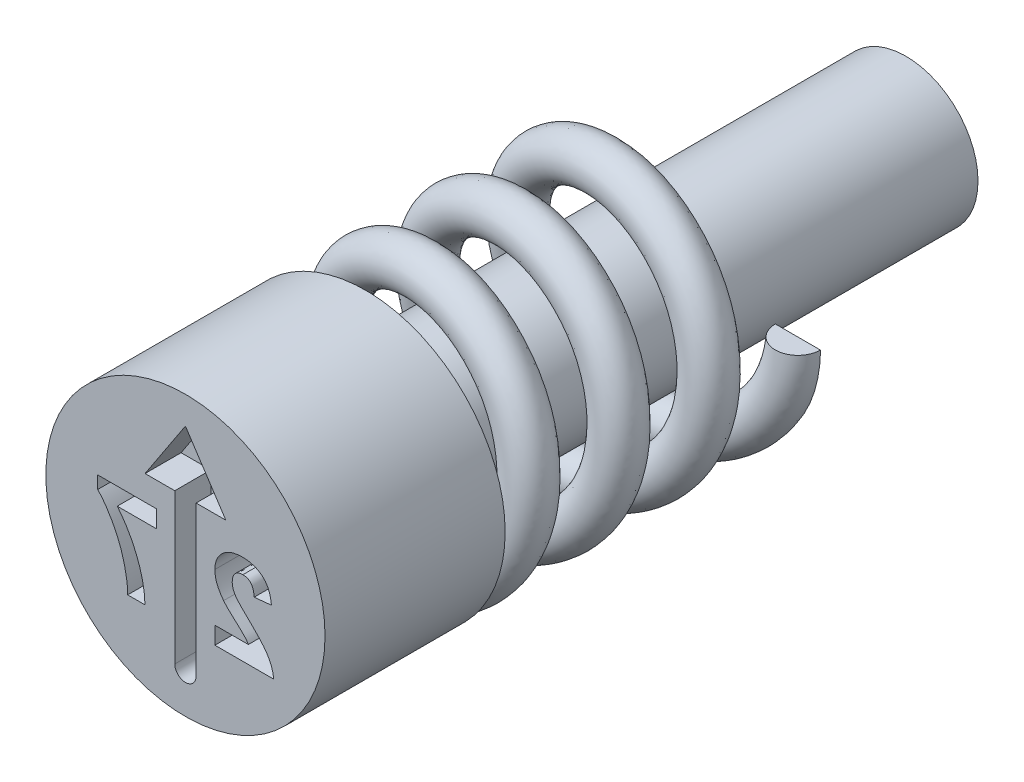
ISO-10303-21;
HEADER;
FILE_DESCRIPTION(('STEP AP214'),'2;1');
FILE_NAME('part.step','',(''),(''),'','','');
FILE_SCHEMA(('AUTOMOTIVE_DESIGN { 1 0 10303 214 1 1 1 1 }'));
ENDSEC;
DATA;
#1=APPLICATION_CONTEXT('core data for automotive mechanical design processes');
#2=APPLICATION_PROTOCOL_DEFINITION('international standard','automotive_design',2000,#1);
#3=PRODUCT_CONTEXT('',#1,'mechanical');
#4=PRODUCT('Part','Part','',(#3));
#5=PRODUCT_RELATED_PRODUCT_CATEGORY('part','',(#4));
#6=PRODUCT_DEFINITION_FORMATION('','',#4);
#7=PRODUCT_DEFINITION_CONTEXT('part definition',#1,'design');
#8=PRODUCT_DEFINITION('design','',#6,#7);
#9=PRODUCT_DEFINITION_SHAPE('','',#8);
#10=(LENGTH_UNIT() NAMED_UNIT(*) SI_UNIT(.MILLI.,.METRE.));
#11=(NAMED_UNIT(*) PLANE_ANGLE_UNIT() SI_UNIT($,.RADIAN.));
#12=(NAMED_UNIT(*) SI_UNIT($,.STERADIAN.) SOLID_ANGLE_UNIT());
#13=UNCERTAINTY_MEASURE_WITH_UNIT(LENGTH_MEASURE(1.E-05),#10,'distance_accuracy_value','');
#14=(GEOMETRIC_REPRESENTATION_CONTEXT(3) GLOBAL_UNCERTAINTY_ASSIGNED_CONTEXT((#13)) GLOBAL_UNIT_ASSIGNED_CONTEXT((#10,
#11,#12)) REPRESENTATION_CONTEXT('',''));
#15=CARTESIAN_POINT('',(0.,0.,0.));
#16=DIRECTION('',(0.,0.,1.));
#17=DIRECTION('',(1.,0.,0.));
#18=AXIS2_PLACEMENT_3D('',#15,#16,#17);
#19=CARTESIAN_POINT('',(1.3,0.,-5.75));
#20=DIRECTION('',(0.,-1.,0.));
#21=DIRECTION('',(0.,0.,-1.));
#22=AXIS2_PLACEMENT_3D('',#19,#20,#21);
#23=PLANE('',#22);
#24=CARTESIAN_POINT('',(1.3,0.,-5.5));
#25=DIRECTION('',(0.,1.,0.));
#26=DIRECTION('',(0.,0.,1.));
#27=AXIS2_PLACEMENT_3D('',#24,#25,#26);
#28=CIRCLE('',#27,0.25);
#29=CARTESIAN_POINT('',(1.05,0.,-5.5));
#30=VERTEX_POINT('',#29);
#31=CARTESIAN_POINT('',(1.55,0.,-5.5));
#32=VERTEX_POINT('',#31);
#33=EDGE_CURVE('E88',#30,#32,#28,.T.);
#34=ORIENTED_EDGE('',*,*,#33,.T.);
#35=DIRECTION('',(-1.,0.,0.));
#36=VECTOR('',#35,1.);
#37=CARTESIAN_POINT('',(1.3,0.,-5.5));
#38=LINE('',#37,#36);
#39=EDGE_CURVE('E75',#32,#30,#38,.T.);
#40=ORIENTED_EDGE('',*,*,#39,.T.);
#41=EDGE_LOOP('',(#34,#40));
#42=FACE_BOUND('',#41,.T.);
#43=ADVANCED_FACE('F49',(#42),#23,.F.);
#44=CARTESIAN_POINT('',(-1.3,0.,-2.25));
#45=DIRECTION('',(0.,1.,0.));
#46=DIRECTION('',(-1.,0.,0.));
#47=AXIS2_PLACEMENT_3D('',#44,#45,#46);
#48=PLANE('',#47);
#49=DIRECTION('',(-1.,0.,0.));
#50=VECTOR('',#49,1.);
#51=CARTESIAN_POINT('',(-1.3,0.,-2.));
#52=LINE('',#51,#50);
#53=CARTESIAN_POINT('',(-1.05,0.,-2.));
#54=VERTEX_POINT('',#53);
#55=CARTESIAN_POINT('',(-1.55,0.,-2.));
#56=VERTEX_POINT('',#55);
#57=EDGE_CURVE('E69',#54,#56,#52,.T.);
#58=ORIENTED_EDGE('',*,*,#57,.F.);
#59=CARTESIAN_POINT('',(-1.3,0.,-2.));
#60=DIRECTION('',(0.,1.,0.));
#61=DIRECTION('',(-1.,0.,0.));
#62=AXIS2_PLACEMENT_3D('',#59,#60,#61);
#63=CIRCLE('',#62,0.25);
#64=EDGE_CURVE('E85',#54,#56,#63,.T.);
#65=ORIENTED_EDGE('',*,*,#64,.T.);
#66=EDGE_LOOP('',(#58,#65));
#67=FACE_BOUND('',#66,.T.);
#68=ADVANCED_FACE('F51',(#67),#48,.T.);
#69=CARTESIAN_POINT('',(1.3,0.,-5.25));
#70=CARTESIAN_POINT('',(1.3,-0.538477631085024,-5.1875));
#71=CARTESIAN_POINT('',(0.919238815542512,-0.919238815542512,-5.125));
#72=CARTESIAN_POINT('',(0.538477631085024,-1.3,-5.0625));
#73=CARTESIAN_POINT('',(0.,-1.3,-5.));
#74=CARTESIAN_POINT('',(-0.538477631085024,-1.3,-4.9375));
#75=CARTESIAN_POINT('',(-0.919238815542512,-0.919238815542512,-4.875));
#76=CARTESIAN_POINT('',(-1.3,-0.538477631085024,-4.8125));
#77=CARTESIAN_POINT('',(-1.3,0.,-4.75));
#78=CARTESIAN_POINT('',(-1.3,0.538477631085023,-4.6875));
#79=CARTESIAN_POINT('',(-0.919238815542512,0.919238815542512,-4.625));
#80=CARTESIAN_POINT('',(-0.538477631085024,1.3,-4.5625));
#81=CARTESIAN_POINT('',(0.,1.3,-4.5));
#82=CARTESIAN_POINT('',(0.538477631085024,1.3,-4.4375));
#83=CARTESIAN_POINT('',(0.919238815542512,0.919238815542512,-4.375));
#84=CARTESIAN_POINT('',(1.3,0.538477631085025,-4.3125));
#85=CARTESIAN_POINT('',(1.3,0.,-4.25));
#86=CARTESIAN_POINT('',(1.3,-0.538477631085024,-4.1875));
#87=CARTESIAN_POINT('',(0.919238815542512,-0.919238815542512,-4.125));
#88=CARTESIAN_POINT('',(0.538477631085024,-1.3,-4.0625));
#89=CARTESIAN_POINT('',(0.,-1.3,-4.));
#90=CARTESIAN_POINT('',(-0.538477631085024,-1.3,-3.9375));
#91=CARTESIAN_POINT('',(-0.919238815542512,-0.919238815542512,-3.875));
#92=CARTESIAN_POINT('',(-1.3,-0.538477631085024,-3.8125));
#93=CARTESIAN_POINT('',(-1.3,0.,-3.75));
#94=CARTESIAN_POINT('',(-1.3,0.538477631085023,-3.6875));
#95=CARTESIAN_POINT('',(-0.919238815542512,0.919238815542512,-3.625));
#96=CARTESIAN_POINT('',(-0.538477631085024,1.3,-3.5625));
#97=CARTESIAN_POINT('',(0.,1.3,-3.5));
#98=CARTESIAN_POINT('',(0.538477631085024,1.3,-3.4375));
#99=CARTESIAN_POINT('',(0.919238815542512,0.919238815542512,-3.375));
#100=CARTESIAN_POINT('',(1.3,0.538477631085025,-3.3125));
#101=CARTESIAN_POINT('',(1.3,0.,-3.25));
#102=CARTESIAN_POINT('',(1.3,-0.538477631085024,-3.1875));
#103=CARTESIAN_POINT('',(0.919238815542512,-0.919238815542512,-3.125));
#104=CARTESIAN_POINT('',(0.538477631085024,-1.3,-3.0625));
#105=CARTESIAN_POINT('',(0.,-1.3,-3.));
#106=CARTESIAN_POINT('',(-0.538477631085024,-1.3,-2.9375));
#107=CARTESIAN_POINT('',(-0.919238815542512,-0.919238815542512,-2.875));
#108=CARTESIAN_POINT('',(-1.3,-0.538477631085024,-2.8125));
#109=CARTESIAN_POINT('',(-1.3,0.,-2.75));
#110=CARTESIAN_POINT('',(-1.3,0.538477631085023,-2.6875));
#111=CARTESIAN_POINT('',(-0.919238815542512,0.919238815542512,-2.625));
#112=CARTESIAN_POINT('',(-0.538477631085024,1.3,-2.5625));
#113=CARTESIAN_POINT('',(0.,1.3,-2.5));
#114=CARTESIAN_POINT('',(0.538477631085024,1.3,-2.4375));
#115=CARTESIAN_POINT('',(0.919238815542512,0.919238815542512,-2.375));
#116=CARTESIAN_POINT('',(1.3,0.538477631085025,-2.3125));
#117=CARTESIAN_POINT('',(1.3,0.,-2.25));
#118=CARTESIAN_POINT('',(1.3,-0.538477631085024,-2.1875));
#119=CARTESIAN_POINT('',(0.919238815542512,-0.919238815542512,-2.125));
#120=CARTESIAN_POINT('',(0.538477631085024,-1.3,-2.0625));
#121=CARTESIAN_POINT('',(0.,-1.3,-2.));
#122=CARTESIAN_POINT('',(-0.538477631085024,-1.3,-1.9375));
#123=CARTESIAN_POINT('',(-0.919238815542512,-0.919238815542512,-1.875));
#124=CARTESIAN_POINT('',(-1.3,-0.538477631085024,-1.8125));
#125=CARTESIAN_POINT('',(-1.3,0.,-1.75));
#126=CARTESIAN_POINT('',(1.8,0.,-5.25));
#127=CARTESIAN_POINT('',(1.8,-0.745584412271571,-5.1875));
#128=CARTESIAN_POINT('',(1.27279220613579,-1.27279220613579,-5.125));
#129=CARTESIAN_POINT('',(0.745584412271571,-1.8,-5.0625));
#130=CARTESIAN_POINT('',(0.,-1.8,-5.));
#131=CARTESIAN_POINT('',(-0.745584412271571,-1.8,-4.9375));
#132=CARTESIAN_POINT('',(-1.27279220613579,-1.27279220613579,-4.875));
#133=CARTESIAN_POINT('',(-1.8,-0.745584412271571,-4.8125));
#134=CARTESIAN_POINT('',(-1.8,0.,-4.75));
#135=CARTESIAN_POINT('',(-1.8,0.745584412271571,-4.6875));
#136=CARTESIAN_POINT('',(-1.27279220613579,1.27279220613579,-4.625));
#137=CARTESIAN_POINT('',(-0.745584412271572,1.8,-4.5625));
#138=CARTESIAN_POINT('',(0.,1.8,-4.5));
#139=CARTESIAN_POINT('',(0.745584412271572,1.8,-4.4375));
#140=CARTESIAN_POINT('',(1.27279220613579,1.27279220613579,-4.375));
#141=CARTESIAN_POINT('',(1.8,0.745584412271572,-4.3125));
#142=CARTESIAN_POINT('',(1.8,0.,-4.25));
#143=CARTESIAN_POINT('',(1.8,-0.745584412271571,-4.1875));
#144=CARTESIAN_POINT('',(1.27279220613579,-1.27279220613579,-4.125));
#145=CARTESIAN_POINT('',(0.745584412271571,-1.8,-4.0625));
#146=CARTESIAN_POINT('',(0.,-1.8,-4.));
#147=CARTESIAN_POINT('',(-0.745584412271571,-1.8,-3.9375));
#148=CARTESIAN_POINT('',(-1.27279220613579,-1.27279220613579,-3.875));
#149=CARTESIAN_POINT('',(-1.8,-0.745584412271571,-3.8125));
#150=CARTESIAN_POINT('',(-1.8,0.,-3.75));
#151=CARTESIAN_POINT('',(-1.8,0.745584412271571,-3.6875));
#152=CARTESIAN_POINT('',(-1.27279220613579,1.27279220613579,-3.625));
#153=CARTESIAN_POINT('',(-0.745584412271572,1.8,-3.5625));
#154=CARTESIAN_POINT('',(0.,1.8,-3.5));
#155=CARTESIAN_POINT('',(0.745584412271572,1.8,-3.4375));
#156=CARTESIAN_POINT('',(1.27279220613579,1.27279220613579,-3.375));
#157=CARTESIAN_POINT('',(1.8,0.745584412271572,-3.3125));
#158=CARTESIAN_POINT('',(1.8,0.,-3.25));
#159=CARTESIAN_POINT('',(1.8,-0.745584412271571,-3.1875));
#160=CARTESIAN_POINT('',(1.27279220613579,-1.27279220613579,-3.125));
#161=CARTESIAN_POINT('',(0.745584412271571,-1.8,-3.0625));
#162=CARTESIAN_POINT('',(0.,-1.8,-3.));
#163=CARTESIAN_POINT('',(-0.745584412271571,-1.8,-2.9375));
#164=CARTESIAN_POINT('',(-1.27279220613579,-1.27279220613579,-2.875));
#165=CARTESIAN_POINT('',(-1.8,-0.745584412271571,-2.8125));
#166=CARTESIAN_POINT('',(-1.8,0.,-2.75));
#167=CARTESIAN_POINT('',(-1.8,0.745584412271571,-2.6875));
#168=CARTESIAN_POINT('',(-1.27279220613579,1.27279220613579,-2.625));
#169=CARTESIAN_POINT('',(-0.745584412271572,1.8,-2.5625));
#170=CARTESIAN_POINT('',(0.,1.8,-2.5));
#171=CARTESIAN_POINT('',(0.745584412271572,1.8,-2.4375));
#172=CARTESIAN_POINT('',(1.27279220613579,1.27279220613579,-2.375));
#173=CARTESIAN_POINT('',(1.8,0.745584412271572,-2.3125));
#174=CARTESIAN_POINT('',(1.8,0.,-2.25));
#175=CARTESIAN_POINT('',(1.8,-0.745584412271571,-2.1875));
#176=CARTESIAN_POINT('',(1.27279220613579,-1.27279220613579,-2.125));
#177=CARTESIAN_POINT('',(0.745584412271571,-1.8,-2.0625));
#178=CARTESIAN_POINT('',(0.,-1.8,-2.));
#179=CARTESIAN_POINT('',(-0.745584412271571,-1.8,-1.9375));
#180=CARTESIAN_POINT('',(-1.27279220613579,-1.27279220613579,-1.875));
#181=CARTESIAN_POINT('',(-1.8,-0.745584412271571,-1.8125));
#182=CARTESIAN_POINT('',(-1.8,0.,-1.75));
#183=CARTESIAN_POINT('',(1.8,0.,-5.75));
#184=CARTESIAN_POINT('',(1.8,-0.745584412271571,-5.6875));
#185=CARTESIAN_POINT('',(1.27279220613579,-1.27279220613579,-5.625));
#186=CARTESIAN_POINT('',(0.745584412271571,-1.8,-5.5625));
#187=CARTESIAN_POINT('',(0.,-1.8,-5.5));
#188=CARTESIAN_POINT('',(-0.745584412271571,-1.8,-5.4375));
#189=CARTESIAN_POINT('',(-1.27279220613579,-1.27279220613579,-5.375));
#190=CARTESIAN_POINT('',(-1.8,-0.745584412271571,-5.3125));
#191=CARTESIAN_POINT('',(-1.8,0.,-5.25));
#192=CARTESIAN_POINT('',(-1.8,0.745584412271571,-5.1875));
#193=CARTESIAN_POINT('',(-1.27279220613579,1.27279220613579,-5.125));
#194=CARTESIAN_POINT('',(-0.745584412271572,1.8,-5.0625));
#195=CARTESIAN_POINT('',(0.,1.8,-5.));
#196=CARTESIAN_POINT('',(0.745584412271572,1.8,-4.9375));
#197=CARTESIAN_POINT('',(1.27279220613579,1.27279220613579,-4.875));
#198=CARTESIAN_POINT('',(1.8,0.745584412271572,-4.8125));
#199=CARTESIAN_POINT('',(1.8,0.,-4.75));
#200=CARTESIAN_POINT('',(1.8,-0.745584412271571,-4.6875));
#201=CARTESIAN_POINT('',(1.27279220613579,-1.27279220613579,-4.625));
#202=CARTESIAN_POINT('',(0.745584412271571,-1.8,-4.5625));
#203=CARTESIAN_POINT('',(0.,-1.8,-4.5));
#204=CARTESIAN_POINT('',(-0.745584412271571,-1.8,-4.4375));
#205=CARTESIAN_POINT('',(-1.27279220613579,-1.27279220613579,-4.375));
#206=CARTESIAN_POINT('',(-1.8,-0.745584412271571,-4.3125));
#207=CARTESIAN_POINT('',(-1.8,0.,-4.25));
#208=CARTESIAN_POINT('',(-1.8,0.745584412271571,-4.1875));
#209=CARTESIAN_POINT('',(-1.27279220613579,1.27279220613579,-4.125));
#210=CARTESIAN_POINT('',(-0.745584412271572,1.8,-4.0625));
#211=CARTESIAN_POINT('',(0.,1.8,-4.));
#212=CARTESIAN_POINT('',(0.745584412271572,1.8,-3.9375));
#213=CARTESIAN_POINT('',(1.27279220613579,1.27279220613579,-3.875));
#214=CARTESIAN_POINT('',(1.8,0.745584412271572,-3.8125));
#215=CARTESIAN_POINT('',(1.8,0.,-3.75));
#216=CARTESIAN_POINT('',(1.8,-0.745584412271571,-3.6875));
#217=CARTESIAN_POINT('',(1.27279220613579,-1.27279220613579,-3.625));
#218=CARTESIAN_POINT('',(0.745584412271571,-1.8,-3.5625));
#219=CARTESIAN_POINT('',(0.,-1.8,-3.5));
#220=CARTESIAN_POINT('',(-0.745584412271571,-1.8,-3.4375));
#221=CARTESIAN_POINT('',(-1.27279220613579,-1.27279220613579,-3.375));
#222=CARTESIAN_POINT('',(-1.8,-0.745584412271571,-3.3125));
#223=CARTESIAN_POINT('',(-1.8,0.,-3.25));
#224=CARTESIAN_POINT('',(-1.8,0.745584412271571,-3.1875));
#225=CARTESIAN_POINT('',(-1.27279220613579,1.27279220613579,-3.125));
#226=CARTESIAN_POINT('',(-0.745584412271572,1.8,-3.0625));
#227=CARTESIAN_POINT('',(0.,1.8,-3.));
#228=CARTESIAN_POINT('',(0.745584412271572,1.8,-2.9375));
#229=CARTESIAN_POINT('',(1.27279220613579,1.27279220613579,-2.875));
#230=CARTESIAN_POINT('',(1.8,0.745584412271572,-2.8125));
#231=CARTESIAN_POINT('',(1.8,0.,-2.75));
#232=CARTESIAN_POINT('',(1.8,-0.745584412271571,-2.6875));
#233=CARTESIAN_POINT('',(1.27279220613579,-1.27279220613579,-2.625));
#234=CARTESIAN_POINT('',(0.745584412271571,-1.8,-2.5625));
#235=CARTESIAN_POINT('',(0.,-1.8,-2.5));
#236=CARTESIAN_POINT('',(-0.745584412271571,-1.8,-2.4375));
#237=CARTESIAN_POINT('',(-1.27279220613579,-1.27279220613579,-2.375));
#238=CARTESIAN_POINT('',(-1.8,-0.745584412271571,-2.3125));
#239=CARTESIAN_POINT('',(-1.8,0.,-2.25));
#240=CARTESIAN_POINT('',(1.3,0.,-5.75));
#241=CARTESIAN_POINT('',(1.3,-0.538477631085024,-5.6875));
#242=CARTESIAN_POINT('',(0.919238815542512,-0.919238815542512,-5.625));
#243=CARTESIAN_POINT('',(0.538477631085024,-1.3,-5.5625));
#244=CARTESIAN_POINT('',(0.,-1.3,-5.5));
#245=CARTESIAN_POINT('',(-0.538477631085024,-1.3,-5.4375));
#246=CARTESIAN_POINT('',(-0.919238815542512,-0.919238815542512,-5.375));
#247=CARTESIAN_POINT('',(-1.3,-0.538477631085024,-5.3125));
#248=CARTESIAN_POINT('',(-1.3,0.,-5.25));
#249=CARTESIAN_POINT('',(-1.3,0.538477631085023,-5.1875));
#250=CARTESIAN_POINT('',(-0.919238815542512,0.919238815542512,-5.125));
#251=CARTESIAN_POINT('',(-0.538477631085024,1.3,-5.0625));
#252=CARTESIAN_POINT('',(0.,1.3,-5.));
#253=CARTESIAN_POINT('',(0.538477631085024,1.3,-4.9375));
#254=CARTESIAN_POINT('',(0.919238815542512,0.919238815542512,-4.875));
#255=CARTESIAN_POINT('',(1.3,0.538477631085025,-4.8125));
#256=CARTESIAN_POINT('',(1.3,0.,-4.75));
#257=CARTESIAN_POINT('',(1.3,-0.538477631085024,-4.6875));
#258=CARTESIAN_POINT('',(0.919238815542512,-0.919238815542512,-4.625));
#259=CARTESIAN_POINT('',(0.538477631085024,-1.3,-4.5625));
#260=CARTESIAN_POINT('',(0.,-1.3,-4.5));
#261=CARTESIAN_POINT('',(-0.538477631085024,-1.3,-4.4375));
#262=CARTESIAN_POINT('',(-0.919238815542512,-0.919238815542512,-4.375));
#263=CARTESIAN_POINT('',(-1.3,-0.538477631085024,-4.3125));
#264=CARTESIAN_POINT('',(-1.3,0.,-4.25));
#265=CARTESIAN_POINT('',(-1.3,0.538477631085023,-4.1875));
#266=CARTESIAN_POINT('',(-0.919238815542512,0.919238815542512,-4.125));
#267=CARTESIAN_POINT('',(-0.538477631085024,1.3,-4.0625));
#268=CARTESIAN_POINT('',(0.,1.3,-4.));
#269=CARTESIAN_POINT('',(0.538477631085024,1.3,-3.9375));
#270=CARTESIAN_POINT('',(0.919238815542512,0.919238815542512,-3.875));
#271=CARTESIAN_POINT('',(1.3,0.538477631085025,-3.8125));
#272=CARTESIAN_POINT('',(1.3,0.,-3.75));
#273=CARTESIAN_POINT('',(1.3,-0.538477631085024,-3.6875));
#274=CARTESIAN_POINT('',(0.919238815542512,-0.919238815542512,-3.625));
#275=CARTESIAN_POINT('',(0.538477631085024,-1.3,-3.5625));
#276=CARTESIAN_POINT('',(0.,-1.3,-3.5));
#277=CARTESIAN_POINT('',(-0.538477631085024,-1.3,-3.4375));
#278=CARTESIAN_POINT('',(-0.919238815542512,-0.919238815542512,-3.375));
#279=CARTESIAN_POINT('',(-1.3,-0.538477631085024,-3.3125));
#280=CARTESIAN_POINT('',(-1.3,0.,-3.25));
#281=CARTESIAN_POINT('',(-1.3,0.538477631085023,-3.1875));
#282=CARTESIAN_POINT('',(-0.919238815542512,0.919238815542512,-3.125));
#283=CARTESIAN_POINT('',(-0.538477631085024,1.3,-3.0625));
#284=CARTESIAN_POINT('',(0.,1.3,-3.));
#285=CARTESIAN_POINT('',(0.538477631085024,1.3,-2.9375));
#286=CARTESIAN_POINT('',(0.919238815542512,0.919238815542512,-2.875));
#287=CARTESIAN_POINT('',(1.3,0.538477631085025,-2.8125));
#288=CARTESIAN_POINT('',(1.3,0.,-2.75));
#289=CARTESIAN_POINT('',(1.3,-0.538477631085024,-2.6875));
#290=CARTESIAN_POINT('',(0.919238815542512,-0.919238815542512,-2.625));
#291=CARTESIAN_POINT('',(0.538477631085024,-1.3,-2.5625));
#292=CARTESIAN_POINT('',(0.,-1.3,-2.5));
#293=CARTESIAN_POINT('',(-0.538477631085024,-1.3,-2.4375));
#294=CARTESIAN_POINT('',(-0.919238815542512,-0.919238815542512,-2.375));
#295=CARTESIAN_POINT('',(-1.3,-0.538477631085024,-2.3125));
#296=CARTESIAN_POINT('',(-1.3,0.,-2.25));
#297=CARTESIAN_POINT('',(0.8,0.,-5.75));
#298=CARTESIAN_POINT('',(0.8,-0.331370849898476,-5.6875));
#299=CARTESIAN_POINT('',(0.565685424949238,-0.565685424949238,-5.625));
#300=CARTESIAN_POINT('',(0.331370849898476,-0.8,-5.5625));
#301=CARTESIAN_POINT('',(0.,-0.8,-5.5));
#302=CARTESIAN_POINT('',(-0.331370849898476,-0.8,-5.4375));
#303=CARTESIAN_POINT('',(-0.565685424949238,-0.565685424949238,-5.375));
#304=CARTESIAN_POINT('',(-0.8,-0.331370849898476,-5.3125));
#305=CARTESIAN_POINT('',(-0.8,0.,-5.25));
#306=CARTESIAN_POINT('',(-0.8,0.331370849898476,-5.1875));
#307=CARTESIAN_POINT('',(-0.565685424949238,0.565685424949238,-5.125));
#308=CARTESIAN_POINT('',(-0.331370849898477,0.8,-5.0625));
#309=CARTESIAN_POINT('',(0.,0.8,-5.));
#310=CARTESIAN_POINT('',(0.331370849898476,0.8,-4.9375));
#311=CARTESIAN_POINT('',(0.565685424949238,0.565685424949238,-4.875));
#312=CARTESIAN_POINT('',(0.8,0.331370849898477,-4.8125));
#313=CARTESIAN_POINT('',(0.8,0.,-4.75));
#314=CARTESIAN_POINT('',(0.8,-0.331370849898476,-4.6875));
#315=CARTESIAN_POINT('',(0.565685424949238,-0.565685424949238,-4.625));
#316=CARTESIAN_POINT('',(0.331370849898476,-0.8,-4.5625));
#317=CARTESIAN_POINT('',(0.,-0.8,-4.5));
#318=CARTESIAN_POINT('',(-0.331370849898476,-0.8,-4.4375));
#319=CARTESIAN_POINT('',(-0.565685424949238,-0.565685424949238,-4.375));
#320=CARTESIAN_POINT('',(-0.8,-0.331370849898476,-4.3125));
#321=CARTESIAN_POINT('',(-0.8,0.,-4.25));
#322=CARTESIAN_POINT('',(-0.8,0.331370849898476,-4.1875));
#323=CARTESIAN_POINT('',(-0.565685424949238,0.565685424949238,-4.125));
#324=CARTESIAN_POINT('',(-0.331370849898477,0.8,-4.0625));
#325=CARTESIAN_POINT('',(0.,0.8,-4.));
#326=CARTESIAN_POINT('',(0.331370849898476,0.8,-3.9375));
#327=CARTESIAN_POINT('',(0.565685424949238,0.565685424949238,-3.875));
#328=CARTESIAN_POINT('',(0.8,0.331370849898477,-3.8125));
#329=CARTESIAN_POINT('',(0.8,0.,-3.75));
#330=CARTESIAN_POINT('',(0.8,-0.331370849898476,-3.6875));
#331=CARTESIAN_POINT('',(0.565685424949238,-0.565685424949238,-3.625));
#332=CARTESIAN_POINT('',(0.331370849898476,-0.8,-3.5625));
#333=CARTESIAN_POINT('',(0.,-0.8,-3.5));
#334=CARTESIAN_POINT('',(-0.331370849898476,-0.8,-3.4375));
#335=CARTESIAN_POINT('',(-0.565685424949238,-0.565685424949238,-3.375));
#336=CARTESIAN_POINT('',(-0.8,-0.331370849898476,-3.3125));
#337=CARTESIAN_POINT('',(-0.8,0.,-3.25));
#338=CARTESIAN_POINT('',(-0.8,0.331370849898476,-3.1875));
#339=CARTESIAN_POINT('',(-0.565685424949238,0.565685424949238,-3.125));
#340=CARTESIAN_POINT('',(-0.331370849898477,0.8,-3.0625));
#341=CARTESIAN_POINT('',(0.,0.8,-3.));
#342=CARTESIAN_POINT('',(0.331370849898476,0.8,-2.9375));
#343=CARTESIAN_POINT('',(0.565685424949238,0.565685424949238,-2.875));
#344=CARTESIAN_POINT('',(0.8,0.331370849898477,-2.8125));
#345=CARTESIAN_POINT('',(0.8,0.,-2.75));
#346=CARTESIAN_POINT('',(0.8,-0.331370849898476,-2.6875));
#347=CARTESIAN_POINT('',(0.565685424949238,-0.565685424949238,-2.625));
#348=CARTESIAN_POINT('',(0.331370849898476,-0.8,-2.5625));
#349=CARTESIAN_POINT('',(0.,-0.8,-2.5));
#350=CARTESIAN_POINT('',(-0.331370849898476,-0.8,-2.4375));
#351=CARTESIAN_POINT('',(-0.565685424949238,-0.565685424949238,-2.375));
#352=CARTESIAN_POINT('',(-0.8,-0.331370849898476,-2.3125));
#353=CARTESIAN_POINT('',(-0.8,0.,-2.25));
#354=CARTESIAN_POINT('',(0.8,0.,-5.25));
#355=CARTESIAN_POINT('',(0.8,-0.331370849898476,-5.1875));
#356=CARTESIAN_POINT('',(0.565685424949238,-0.565685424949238,-5.125));
#357=CARTESIAN_POINT('',(0.331370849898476,-0.8,-5.0625));
#358=CARTESIAN_POINT('',(0.,-0.8,-5.));
#359=CARTESIAN_POINT('',(-0.331370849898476,-0.8,-4.9375));
#360=CARTESIAN_POINT('',(-0.565685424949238,-0.565685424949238,-4.875));
#361=CARTESIAN_POINT('',(-0.8,-0.331370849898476,-4.8125));
#362=CARTESIAN_POINT('',(-0.8,0.,-4.75));
#363=CARTESIAN_POINT('',(-0.8,0.331370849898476,-4.6875));
#364=CARTESIAN_POINT('',(-0.565685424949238,0.565685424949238,-4.625));
#365=CARTESIAN_POINT('',(-0.331370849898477,0.8,-4.5625));
#366=CARTESIAN_POINT('',(0.,0.8,-4.5));
#367=CARTESIAN_POINT('',(0.331370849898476,0.8,-4.4375));
#368=CARTESIAN_POINT('',(0.565685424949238,0.565685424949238,-4.375));
#369=CARTESIAN_POINT('',(0.8,0.331370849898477,-4.3125));
#370=CARTESIAN_POINT('',(0.8,0.,-4.25));
#371=CARTESIAN_POINT('',(0.8,-0.331370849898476,-4.1875));
#372=CARTESIAN_POINT('',(0.565685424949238,-0.565685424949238,-4.125));
#373=CARTESIAN_POINT('',(0.331370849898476,-0.8,-4.0625));
#374=CARTESIAN_POINT('',(0.,-0.8,-4.));
#375=CARTESIAN_POINT('',(-0.331370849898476,-0.8,-3.9375));
#376=CARTESIAN_POINT('',(-0.565685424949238,-0.565685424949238,-3.875));
#377=CARTESIAN_POINT('',(-0.8,-0.331370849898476,-3.8125));
#378=CARTESIAN_POINT('',(-0.8,0.,-3.75));
#379=CARTESIAN_POINT('',(-0.8,0.331370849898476,-3.6875));
#380=CARTESIAN_POINT('',(-0.565685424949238,0.565685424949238,-3.625));
#381=CARTESIAN_POINT('',(-0.331370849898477,0.8,-3.5625));
#382=CARTESIAN_POINT('',(0.,0.8,-3.5));
#383=CARTESIAN_POINT('',(0.331370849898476,0.8,-3.4375));
#384=CARTESIAN_POINT('',(0.565685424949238,0.565685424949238,-3.375));
#385=CARTESIAN_POINT('',(0.8,0.331370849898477,-3.3125));
#386=CARTESIAN_POINT('',(0.8,0.,-3.25));
#387=CARTESIAN_POINT('',(0.8,-0.331370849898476,-3.1875));
#388=CARTESIAN_POINT('',(0.565685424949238,-0.565685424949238,-3.125));
#389=CARTESIAN_POINT('',(0.331370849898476,-0.8,-3.0625));
#390=CARTESIAN_POINT('',(0.,-0.8,-3.));
#391=CARTESIAN_POINT('',(-0.331370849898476,-0.8,-2.9375));
#392=CARTESIAN_POINT('',(-0.565685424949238,-0.565685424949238,-2.875));
#393=CARTESIAN_POINT('',(-0.8,-0.331370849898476,-2.8125));
#394=CARTESIAN_POINT('',(-0.8,0.,-2.75));
#395=CARTESIAN_POINT('',(-0.8,0.331370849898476,-2.6875));
#396=CARTESIAN_POINT('',(-0.565685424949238,0.565685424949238,-2.625));
#397=CARTESIAN_POINT('',(-0.331370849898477,0.8,-2.5625));
#398=CARTESIAN_POINT('',(0.,0.8,-2.5));
#399=CARTESIAN_POINT('',(0.331370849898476,0.8,-2.4375));
#400=CARTESIAN_POINT('',(0.565685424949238,0.565685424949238,-2.375));
#401=CARTESIAN_POINT('',(0.8,0.331370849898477,-2.3125));
#402=CARTESIAN_POINT('',(0.8,0.,-2.25));
#403=CARTESIAN_POINT('',(0.8,-0.331370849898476,-2.1875));
#404=CARTESIAN_POINT('',(0.565685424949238,-0.565685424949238,-2.125));
#405=CARTESIAN_POINT('',(0.331370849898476,-0.8,-2.0625));
#406=CARTESIAN_POINT('',(0.,-0.8,-2.));
#407=CARTESIAN_POINT('',(-0.331370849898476,-0.8,-1.9375));
#408=CARTESIAN_POINT('',(-0.565685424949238,-0.565685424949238,-1.875));
#409=CARTESIAN_POINT('',(-0.8,-0.331370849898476,-1.8125));
#410=CARTESIAN_POINT('',(-0.8,0.,-1.75));
#411=CARTESIAN_POINT('',(1.3,0.,-5.25));
#412=CARTESIAN_POINT('',(1.3,-0.538477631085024,-5.1875));
#413=CARTESIAN_POINT('',(0.919238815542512,-0.919238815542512,-5.125));
#414=CARTESIAN_POINT('',(0.538477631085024,-1.3,-5.0625));
#415=CARTESIAN_POINT('',(0.,-1.3,-5.));
#416=CARTESIAN_POINT('',(-0.538477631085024,-1.3,-4.9375));
#417=CARTESIAN_POINT('',(-0.919238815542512,-0.919238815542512,-4.875));
#418=CARTESIAN_POINT('',(-1.3,-0.538477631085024,-4.8125));
#419=CARTESIAN_POINT('',(-1.3,0.,-4.75));
#420=CARTESIAN_POINT('',(-1.3,0.538477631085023,-4.6875));
#421=CARTESIAN_POINT('',(-0.919238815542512,0.919238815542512,-4.625));
#422=CARTESIAN_POINT('',(-0.538477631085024,1.3,-4.5625));
#423=CARTESIAN_POINT('',(0.,1.3,-4.5));
#424=CARTESIAN_POINT('',(0.538477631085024,1.3,-4.4375));
#425=CARTESIAN_POINT('',(0.919238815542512,0.919238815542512,-4.375));
#426=CARTESIAN_POINT('',(1.3,0.538477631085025,-4.3125));
#427=CARTESIAN_POINT('',(1.3,0.,-4.25));
#428=CARTESIAN_POINT('',(1.3,-0.538477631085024,-4.1875));
#429=CARTESIAN_POINT('',(0.919238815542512,-0.919238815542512,-4.125));
#430=CARTESIAN_POINT('',(0.538477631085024,-1.3,-4.0625));
#431=CARTESIAN_POINT('',(0.,-1.3,-4.));
#432=CARTESIAN_POINT('',(-0.538477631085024,-1.3,-3.9375));
#433=CARTESIAN_POINT('',(-0.919238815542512,-0.919238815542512,-3.875));
#434=CARTESIAN_POINT('',(-1.3,-0.538477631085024,-3.8125));
#435=CARTESIAN_POINT('',(-1.3,0.,-3.75));
#436=CARTESIAN_POINT('',(-1.3,0.538477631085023,-3.6875));
#437=CARTESIAN_POINT('',(-0.919238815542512,0.919238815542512,-3.625));
#438=CARTESIAN_POINT('',(-0.538477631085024,1.3,-3.5625));
#439=CARTESIAN_POINT('',(0.,1.3,-3.5));
#440=CARTESIAN_POINT('',(0.538477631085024,1.3,-3.4375));
#441=CARTESIAN_POINT('',(0.919238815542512,0.919238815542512,-3.375));
#442=CARTESIAN_POINT('',(1.3,0.538477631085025,-3.3125));
#443=CARTESIAN_POINT('',(1.3,0.,-3.25));
#444=CARTESIAN_POINT('',(1.3,-0.538477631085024,-3.1875));
#445=CARTESIAN_POINT('',(0.919238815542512,-0.919238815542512,-3.125));
#446=CARTESIAN_POINT('',(0.538477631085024,-1.3,-3.0625));
#447=CARTESIAN_POINT('',(0.,-1.3,-3.));
#448=CARTESIAN_POINT('',(-0.538477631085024,-1.3,-2.9375));
#449=CARTESIAN_POINT('',(-0.919238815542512,-0.919238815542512,-2.875));
#450=CARTESIAN_POINT('',(-1.3,-0.538477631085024,-2.8125));
#451=CARTESIAN_POINT('',(-1.3,0.,-2.75));
#452=CARTESIAN_POINT('',(-1.3,0.538477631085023,-2.6875));
#453=CARTESIAN_POINT('',(-0.919238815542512,0.919238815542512,-2.625));
#454=CARTESIAN_POINT('',(-0.538477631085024,1.3,-2.5625));
#455=CARTESIAN_POINT('',(0.,1.3,-2.5));
#456=CARTESIAN_POINT('',(0.538477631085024,1.3,-2.4375));
#457=CARTESIAN_POINT('',(0.919238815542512,0.919238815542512,-2.375));
#458=CARTESIAN_POINT('',(1.3,0.538477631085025,-2.3125));
#459=CARTESIAN_POINT('',(1.3,0.,-2.25));
#460=CARTESIAN_POINT('',(1.3,-0.538477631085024,-2.1875));
#461=CARTESIAN_POINT('',(0.919238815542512,-0.919238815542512,-2.125));
#462=CARTESIAN_POINT('',(0.538477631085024,-1.3,-2.0625));
#463=CARTESIAN_POINT('',(0.,-1.3,-2.));
#464=CARTESIAN_POINT('',(-0.538477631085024,-1.3,-1.9375));
#465=CARTESIAN_POINT('',(-0.919238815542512,-0.919238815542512,-1.875));
#466=CARTESIAN_POINT('',(-1.3,-0.538477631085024,-1.8125));
#467=CARTESIAN_POINT('',(-1.3,0.,-1.75));
#468=(BOUNDED_SURFACE() B_SPLINE_SURFACE(3,2,((#69,#70,#71,#72,#73,#74,#75,#76,#77,#78,#79,#80,
#81,#82,#83,#84,#85,#86,#87,#88,#89,#90,#91,#92,#93,#94,#95,#96,#97,#98,#99,#100,#101,#102,#103,
#104,#105,#106,#107,#108,#109,#110,#111,#112,#113,#114,#115,#116,#117,#118,#119,#120,#121,#122,
#123,#124,#125),(#126,#127,#128,#129,#130,#131,#132,#133,#134,#135,#136,#137,#138,#139,#140,
#141,#142,#143,#144,#145,#146,#147,#148,#149,#150,#151,#152,#153,#154,#155,#156,#157,#158,#159,
#160,#161,#162,#163,#164,#165,#166,#167,#168,#169,#170,#171,#172,#173,#174,#175,#176,#177,#178,
#179,#180,#181,#182),(#183,#184,#185,#186,#187,#188,#189,#190,#191,#192,#193,#194,#195,#196,
#197,#198,#199,#200,#201,#202,#203,#204,#205,#206,#207,#208,#209,#210,#211,#212,#213,#214,#215,
#216,#217,#218,#219,#220,#221,#222,#223,#224,#225,#226,#227,#228,#229,#230,#231,#232,#233,#234,
#235,#236,#237,#238,#239),(#240,#241,#242,#243,#244,#245,#246,#247,#248,#249,#250,#251,#252,
#253,#254,#255,#256,#257,#258,#259,#260,#261,#262,#263,#264,#265,#266,#267,#268,#269,#270,#271,
#272,#273,#274,#275,#276,#277,#278,#279,#280,#281,#282,#283,#284,#285,#286,#287,#288,#289,#290,
#291,#292,#293,#294,#295,#296),(#297,#298,#299,#300,#301,#302,#303,#304,#305,#306,#307,#308,
#309,#310,#311,#312,#313,#314,#315,#316,#317,#318,#319,#320,#321,#322,#323,#324,#325,#326,#327,
#328,#329,#330,#331,#332,#333,#334,#335,#336,#337,#338,#339,#340,#341,#342,#343,#344,#345,#346,
#347,#348,#349,#350,#351,#352,#353),(#354,#355,#356,#357,#358,#359,#360,#361,#362,#363,#364,
#365,#366,#367,#368,#369,#370,#371,#372,#373,#374,#375,#376,#377,#378,#379,#380,#381,#382,#383,
#384,#385,#386,#387,#388,#389,#390,#391,#392,#393,#394,#395,#396,#397,#398,#399,#400,#401,#402,
#403,#404,#405,#406,#407,#408,#409,#410),(#411,#412,#413,#414,#415,#416,#417,#418,#419,#420,
#421,#422,#423,#424,#425,#426,#427,#428,#429,#430,#431,#432,#433,#434,#435,#436,#437,#438,#439,
#440,#441,#442,#443,#444,#445,#446,#447,#448,#449,#450,#451,#452,#453,#454,#455,#456,#457,#458,
#459,#460,#461,#462,#463,#464,#465,#466,#467)),.UNSPECIFIED.,.T.,.F.,
.F.) B_SPLINE_SURFACE_WITH_KNOTS((4,3,4),(3,2,2,2,2,2,2,2,2,2,2,2,2,2,2,2,2,2,2,2,2,2,2,2,2,2,2,
2,3),(0.,0.5,1.),(0.,0.03125,0.0625,0.09375,0.125,0.15625,0.1875,0.21875,0.25,0.28125,0.3125,
0.34375,0.375,0.40625,0.4375,0.46875,0.5,0.53125,0.5625,0.59375,0.625,0.65625,0.6875,0.71875,
0.75,0.78125,0.8125,0.84375,0.875),
.UNSPECIFIED.) GEOMETRIC_REPRESENTATION_ITEM() RATIONAL_B_SPLINE_SURFACE(((1.,0.923879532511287,
1.,0.923879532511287,1.,0.923879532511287,1.,0.923879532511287,1.,0.923879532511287,1.,
0.923879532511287,1.,0.923879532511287,1.,0.923879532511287,1.,0.923879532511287,1.,
0.923879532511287,1.,0.923879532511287,1.,0.923879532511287,1.,0.923879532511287,1.,
0.923879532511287,1.,0.923879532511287,1.,0.923879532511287,1.,0.923879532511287,1.,
0.923879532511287,1.,0.923879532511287,1.,0.923879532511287,1.,0.923879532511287,1.,
0.923879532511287,1.,0.923879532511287,1.,0.923879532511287,1.,0.923879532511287,1.,
0.923879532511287,1.,0.923879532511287,1.,0.923879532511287,1.),(0.333333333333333,
0.307959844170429,0.333333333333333,0.307959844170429,0.333333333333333,0.307959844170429,
0.333333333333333,0.307959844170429,0.333333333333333,0.307959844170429,0.333333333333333,
0.307959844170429,0.333333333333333,0.307959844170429,0.333333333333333,0.307959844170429,
0.333333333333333,0.307959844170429,0.333333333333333,0.307959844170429,0.333333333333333,
0.307959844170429,0.333333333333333,0.307959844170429,0.333333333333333,0.307959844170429,
0.333333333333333,0.307959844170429,0.333333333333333,0.307959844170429,0.333333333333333,
0.307959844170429,0.333333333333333,0.307959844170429,0.333333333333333,0.307959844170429,
0.333333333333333,0.307959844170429,0.333333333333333,0.307959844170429,0.333333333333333,
0.307959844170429,0.333333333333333,0.307959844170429,0.333333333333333,0.307959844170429,
0.333333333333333,0.307959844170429,0.333333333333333,0.307959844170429,0.333333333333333,
0.307959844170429,0.333333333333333,0.307959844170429,0.333333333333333,0.307959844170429,
0.333333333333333),(0.333333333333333,0.307959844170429,0.333333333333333,0.307959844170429,
0.333333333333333,0.307959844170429,0.333333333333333,0.307959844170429,0.333333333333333,
0.307959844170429,0.333333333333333,0.307959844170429,0.333333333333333,0.307959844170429,
0.333333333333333,0.307959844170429,0.333333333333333,0.307959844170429,0.333333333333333,
0.307959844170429,0.333333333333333,0.307959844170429,0.333333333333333,0.307959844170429,
0.333333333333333,0.307959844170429,0.333333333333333,0.307959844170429,0.333333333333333,
0.307959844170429,0.333333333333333,0.307959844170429,0.333333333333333,0.307959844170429,
0.333333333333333,0.307959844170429,0.333333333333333,0.307959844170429,0.333333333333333,
0.307959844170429,0.333333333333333,0.307959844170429,0.333333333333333,0.307959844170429,
0.333333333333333,0.307959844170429,0.333333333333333,0.307959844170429,0.333333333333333,
0.307959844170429,0.333333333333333,0.307959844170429,0.333333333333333,0.307959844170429,
0.333333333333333,0.307959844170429,0.333333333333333),(1.,0.923879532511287,1.,
0.923879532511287,1.,0.923879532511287,1.,0.923879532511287,1.,0.923879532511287,1.,
0.923879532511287,1.,0.923879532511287,1.,0.923879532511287,1.,0.923879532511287,1.,
0.923879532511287,1.,0.923879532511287,1.,0.923879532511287,1.,0.923879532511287,1.,
0.923879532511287,1.,0.923879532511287,1.,0.923879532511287,1.,0.923879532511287,1.,
0.923879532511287,1.,0.923879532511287,1.,0.923879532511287,1.,0.923879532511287,1.,
0.923879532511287,1.,0.923879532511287,1.,0.923879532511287,1.,0.923879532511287,1.,
0.923879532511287,1.,0.923879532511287,1.,0.923879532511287,1.),(0.333333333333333,
0.307959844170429,0.333333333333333,0.307959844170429,0.333333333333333,0.307959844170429,
0.333333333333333,0.307959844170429,0.333333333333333,0.307959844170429,0.333333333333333,
0.307959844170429,0.333333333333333,0.307959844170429,0.333333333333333,0.307959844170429,
0.333333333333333,0.307959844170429,0.333333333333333,0.307959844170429,0.333333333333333,
0.307959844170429,0.333333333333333,0.307959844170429,0.333333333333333,0.307959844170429,
0.333333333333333,0.307959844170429,0.333333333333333,0.307959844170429,0.333333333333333,
0.307959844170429,0.333333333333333,0.307959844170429,0.333333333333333,0.307959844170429,
0.333333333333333,0.307959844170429,0.333333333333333,0.307959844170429,0.333333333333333,
0.307959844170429,0.333333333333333,0.307959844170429,0.333333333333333,0.307959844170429,
0.333333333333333,0.307959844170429,0.333333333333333,0.307959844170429,0.333333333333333,
0.307959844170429,0.333333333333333,0.307959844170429,0.333333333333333,0.307959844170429,
0.333333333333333),(0.333333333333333,0.307959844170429,0.333333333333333,0.307959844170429,
0.333333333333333,0.307959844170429,0.333333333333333,0.307959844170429,0.333333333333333,
0.307959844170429,0.333333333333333,0.307959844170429,0.333333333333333,0.307959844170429,
0.333333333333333,0.307959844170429,0.333333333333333,0.307959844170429,0.333333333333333,
0.307959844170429,0.333333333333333,0.307959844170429,0.333333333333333,0.307959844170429,
0.333333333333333,0.307959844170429,0.333333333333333,0.307959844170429,0.333333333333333,
0.307959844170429,0.333333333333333,0.307959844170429,0.333333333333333,0.307959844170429,
0.333333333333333,0.307959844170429,0.333333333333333,0.307959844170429,0.333333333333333,
0.307959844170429,0.333333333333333,0.307959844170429,0.333333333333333,0.307959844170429,
0.333333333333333,0.307959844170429,0.333333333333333,0.307959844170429,0.333333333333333,
0.307959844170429,0.333333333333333,0.307959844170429,0.333333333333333,0.307959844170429,
0.333333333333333,0.307959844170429,0.333333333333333),(1.,0.923879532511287,1.,
0.923879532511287,1.,0.923879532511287,1.,0.923879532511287,1.,0.923879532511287,1.,
0.923879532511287,1.,0.923879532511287,1.,0.923879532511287,1.,0.923879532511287,1.,
0.923879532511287,1.,0.923879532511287,1.,0.923879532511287,1.,0.923879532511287,1.,
0.923879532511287,1.,0.923879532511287,1.,0.923879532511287,1.,0.923879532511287,1.,
0.923879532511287,1.,0.923879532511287,1.,0.923879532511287,1.,0.923879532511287,1.,
0.923879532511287,1.,0.923879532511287,1.,0.923879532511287,1.,0.923879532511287,1.,
0.923879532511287,1.,0.923879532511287,1.,0.923879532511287,1.))) REPRESENTATION_ITEM('') SURFACE());
#469=CARTESIAN_POINT('',(1.05,0.,-5.5));
#470=CARTESIAN_POINT('',(1.05004023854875,-0.065567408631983,-5.5));
#471=CARTESIAN_POINT('',(1.04439509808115,-0.131091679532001,-5.5));
#472=CARTESIAN_POINT('',(1.02231800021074,-0.260106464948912,-5.5));
#473=CARTESIAN_POINT('',(1.00591764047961,-0.323602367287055,-5.5));
#474=CARTESIAN_POINT('',(0.962903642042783,-0.447028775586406,-5.5));
#475=CARTESIAN_POINT('',(0.936288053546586,-0.506958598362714,-5.5));
#476=CARTESIAN_POINT('',(0.873593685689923,-0.621757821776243,-5.5));
#477=CARTESIAN_POINT('',(0.837506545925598,-0.676622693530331,-5.5));
#478=CARTESIAN_POINT('',(0.77655938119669,-0.754465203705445,-5.5));
#479=CARTESIAN_POINT('',(0.754811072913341,-0.779941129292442,-5.5));
#480=CARTESIAN_POINT('',(0.709428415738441,-0.829161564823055,-5.5));
#481=CARTESIAN_POINT('',(0.68579390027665,-0.852905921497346,-5.5));
#482=CARTESIAN_POINT('',(0.636876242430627,-0.898528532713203,-5.5));
#483=CARTESIAN_POINT('',(0.611596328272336,-0.920410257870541,-5.50000000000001));
#484=CARTESIAN_POINT('',(0.55955004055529,-0.962330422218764,-5.49999999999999));
#485=CARTESIAN_POINT('',(0.532783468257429,-0.982368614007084,-5.49999999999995));
#486=CARTESIAN_POINT('',(0.474625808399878,-1.02294574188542,-5.49999999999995));
#487=CARTESIAN_POINT('',(0.443069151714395,-1.0432469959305,-5.49999999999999));
#488=CARTESIAN_POINT('',(0.378684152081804,-1.08165783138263,-5.50000000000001));
#489=CARTESIAN_POINT('',(0.34585658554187,-1.0997687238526,-5.49999999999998));
#490=CARTESIAN_POINT('',(0.279249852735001,-1.13413514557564,-5.50000000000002));
#491=CARTESIAN_POINT('',(0.245470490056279,-1.15039028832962,-5.50000000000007));
#492=CARTESIAN_POINT('',(0.194442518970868,-1.17406361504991,-5.49999999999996));
#493=CARTESIAN_POINT('',(0.177356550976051,-1.181843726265,-5.4999999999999));
#494=CARTESIAN_POINT('',(0.143194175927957,-1.19741723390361,-5.5000000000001));
#495=CARTESIAN_POINT('',(0.126117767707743,-1.2052106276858,-5.50000000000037));
#496=CARTESIAN_POINT('',(0.097135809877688,-1.21897868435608,-5.4999999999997));
#497=CARTESIAN_POINT('',(0.0851707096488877,-1.22482314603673,-5.49999999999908));
#498=CARTESIAN_POINT('',(0.0675074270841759,-1.23410189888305,-5.50000000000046));
#499=CARTESIAN_POINT('',(0.0616740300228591,-1.23727596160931,-5.5000000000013));
#500=CARTESIAN_POINT('',(0.0501655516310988,-1.24389672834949,-5.4999999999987));
#501=CARTESIAN_POINT('',(0.0444903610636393,-1.24734323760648,-5.49999999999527));
#502=CARTESIAN_POINT('',(0.0333338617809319,-1.25473509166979,-5.49999999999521));
#503=CARTESIAN_POINT('',(0.0278573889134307,-1.25868782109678,-5.4999999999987));
#504=CARTESIAN_POINT('',(0.0175458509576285,-1.26732506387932,-5.50000000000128));
#505=CARTESIAN_POINT('',(0.012704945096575,-1.27200190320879,-5.50000000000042));
#506=CARTESIAN_POINT('',(0.0059212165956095,-1.28099175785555,-5.49999999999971));
#507=CARTESIAN_POINT('',(0.00354675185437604,-1.28494182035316,-5.49999999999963));
#508=CARTESIAN_POINT('',(0.000796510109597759,-1.29247828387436,-5.50000000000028));
#509=CARTESIAN_POINT('',(7.79755926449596E-05,-1.29592472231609,-5.50000000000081));
#510=CARTESIAN_POINT('',(-6.5274644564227E-05,-1.30286100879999,-5.49999999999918));
#511=CARTESIAN_POINT('',(0.000513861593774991,-1.30635095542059,-5.49999999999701));
#512=CARTESIAN_POINT('',(0.00300622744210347,-1.31380427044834,-5.49999999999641));
#513=CARTESIAN_POINT('',(0.00522788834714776,-1.3176538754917,-5.4999999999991));
#514=CARTESIAN_POINT('',(0.0101313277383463,-1.32417868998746,-5.50000000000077));
#515=CARTESIAN_POINT('',(0.0127082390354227,-1.32694255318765,-5.50000000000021));
#516=CARTESIAN_POINT('',(0.0182244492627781,-1.33209256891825,-5.49999999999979));
#517=CARTESIAN_POINT('',(0.0211647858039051,-1.33447759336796,-5.49999999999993));
#518=CARTESIAN_POINT('',(0.0285488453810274,-1.33989164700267,-5.50000000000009));
#519=CARTESIAN_POINT('',(0.0331026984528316,-1.34276677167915,-5.50000000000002));
#520=CARTESIAN_POINT('',(0.042460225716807,-1.34808354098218,-5.49999999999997));
#521=CARTESIAN_POINT('',(0.0472643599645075,-1.35052434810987,-5.49999999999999));
#522=CARTESIAN_POINT('',(0.0619457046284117,-1.35736545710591,-5.50000000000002));
#523=CARTESIAN_POINT('',(0.0720556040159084,-1.36126112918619,-5.50000000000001));
#524=CARTESIAN_POINT('',(0.0972888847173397,-1.36974121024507,-5.49999999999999));
#525=CARTESIAN_POINT('',(0.112575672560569,-1.37381572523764,-5.5));
#526=CARTESIAN_POINT('',(0.143457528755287,-1.38061388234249,-5.5));
#527=CARTESIAN_POINT('',(0.159053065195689,-1.38333527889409,-5.5));
#528=CARTESIAN_POINT('',(0.206067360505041,-1.38986942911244,-5.5));
#529=CARTESIAN_POINT('',(0.237714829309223,-1.39205243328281,-5.5));
#530=CARTESIAN_POINT('',(0.297580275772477,-1.39298687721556,-5.5));
#531=CARTESIAN_POINT('',(0.325797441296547,-1.3920852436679,-5.5));
#532=CARTESIAN_POINT('',(0.382068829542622,-1.38789906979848,-5.5));
#533=CARTESIAN_POINT('',(0.410122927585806,-1.38461289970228,-5.5));
#534=CARTESIAN_POINT('',(0.493742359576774,-1.37149669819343,-5.5));
#535=CARTESIAN_POINT('',(0.548817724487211,-1.35840893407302,-5.5));
#536=CARTESIAN_POINT('',(0.659113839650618,-1.32380814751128,-5.5));
#537=CARTESIAN_POINT('',(0.714214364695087,-1.30192043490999,-5.5));
#538=CARTESIAN_POINT('',(0.820816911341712,-1.25066508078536,-5.5));
#539=CARTESIAN_POINT('',(0.872319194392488,-1.22129798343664,-5.5));
#540=CARTESIAN_POINT('',(0.951039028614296,-1.16910877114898,-5.5));
#541=CARTESIAN_POINT('',(0.979689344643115,-1.1484081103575,-5.5));
#542=CARTESIAN_POINT('',(1.03522901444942,-1.10481371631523,-5.5));
#543=CARTESIAN_POINT('',(1.0621197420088,-1.08192172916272,-5.5));
#544=CARTESIAN_POINT('',(1.14014024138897,-1.0102732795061,-5.5));
#545=CARTESIAN_POINT('',(1.18859870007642,-0.95855756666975,-5.49999999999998));
#546=CARTESIAN_POINT('',(1.28158465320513,-0.843172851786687,-5.50000000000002));
#547=CARTESIAN_POINT('',(1.32527713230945,-0.778831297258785,-5.50000000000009));
#548=CARTESIAN_POINT('',(1.40165140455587,-0.643915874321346,-5.49999999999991));
#549=CARTESIAN_POINT('',(1.43433050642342,-0.573340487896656,-5.49999999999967));
#550=CARTESIAN_POINT('',(1.49049812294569,-0.420680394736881,-5.49999999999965));
#551=CARTESIAN_POINT('',(1.51277935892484,-0.338144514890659,-5.49999999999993));
#552=CARTESIAN_POINT('',(1.53509699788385,-0.212413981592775,-5.50000000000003));
#553=CARTESIAN_POINT('',(1.54068551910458,-0.170128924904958,-5.50000000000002));
#554=CARTESIAN_POINT('',(1.54813644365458,-0.085236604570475,-5.49999999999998));
#555=CARTESIAN_POINT('',(1.54999929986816,-0.0426293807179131,-5.49999999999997));
#556=CARTESIAN_POINT('',(1.55,0.,-5.5));
#557=B_SPLINE_CURVE_WITH_KNOTS('',3,(#469,#470,#471,#472,#473,#474,#475,#476,#477,#478,#479,
#480,#481,#482,#483,#484,#485,#486,#487,#488,#489,#490,#491,#492,#493,#494,#495,#496,#497,#498,
#499,#500,#501,#502,#503,#504,#505,#506,#507,#508,#509,#510,#511,#512,#513,#514,#515,#516,#517,
#518,#519,#520,#521,#522,#523,#524,#525,#526,#527,#528,#529,#530,#531,#532,#533,#534,#535,#536,
#537,#538,#539,#540,#541,#542,#543,#544,#545,#546,#547,#548,#549,#550,#551,#552,#553,#554,#555,
#556),.UNSPECIFIED.,.F.,.F.,(4,2,2,2,2,2,2,2,2,2,2,2,2,2,2,2,2,2,2,2,2,2,2,2,2,2,2,2,2,2,2,2,2,
2,2,2,2,2,2,2,2,2,2,4),(0.,0.19640139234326,0.392228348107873,0.588092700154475,
0.784130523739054,0.884529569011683,0.984937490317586,1.08515402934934,1.18538399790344,
1.29785399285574,1.4102563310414,1.52268203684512,1.5790047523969,1.6353173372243,
1.67525333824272,1.69517261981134,1.71507778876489,1.73531616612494,1.75535313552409,
1.76897470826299,1.77932961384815,1.7897152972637,1.80280846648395,1.81410624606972,
1.82543706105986,1.84155724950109,1.857708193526,1.89013811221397,1.9375125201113,
1.98496528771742,2.07986766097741,2.16446347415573,2.24911716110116,2.41826767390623,
2.59554760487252,2.7728146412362,2.87875081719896,2.98460327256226,3.19637847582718,
3.42866036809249,3.66099898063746,3.91599867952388,4.04381665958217,4.17161910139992),.UNSPECIFIED.);
#558=EDGE_CURVE('E63',#30,#32,#557,.T.);
#559=CARTESIAN_POINT('',(-1.05,0.,-2.));
#560=CARTESIAN_POINT('',(-1.05004023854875,-0.0655674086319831,-2.));
#561=CARTESIAN_POINT('',(-1.04439509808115,-0.131091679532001,-2.));
#562=CARTESIAN_POINT('',(-1.02231800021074,-0.260106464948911,-2.));
#563=CARTESIAN_POINT('',(-1.00591764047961,-0.323602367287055,-2.));
#564=CARTESIAN_POINT('',(-0.962903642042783,-0.447028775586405,-2.));
#565=CARTESIAN_POINT('',(-0.936288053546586,-0.506958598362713,-2.));
#566=CARTESIAN_POINT('',(-0.873593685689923,-0.621757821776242,-2.));
#567=CARTESIAN_POINT('',(-0.837506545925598,-0.676622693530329,-2.));
#568=CARTESIAN_POINT('',(-0.776559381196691,-0.754465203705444,-2.));
#569=CARTESIAN_POINT('',(-0.754811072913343,-0.779941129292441,-2.));
#570=CARTESIAN_POINT('',(-0.709428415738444,-0.829161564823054,-2.));
#571=CARTESIAN_POINT('',(-0.685793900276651,-0.852905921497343,-2.));
#572=CARTESIAN_POINT('',(-0.636876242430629,-0.8985285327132,-2.));
#573=CARTESIAN_POINT('',(-0.611596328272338,-0.920410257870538,-1.99999999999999));
#574=CARTESIAN_POINT('',(-0.559550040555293,-0.962330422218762,-2.00000000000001));
#575=CARTESIAN_POINT('',(-0.532783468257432,-0.982368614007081,-2.00000000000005));
#576=CARTESIAN_POINT('',(-0.474625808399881,-1.02294574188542,-2.00000000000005));
#577=CARTESIAN_POINT('',(-0.4430691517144,-1.0432469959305,-2.00000000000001));
#578=CARTESIAN_POINT('',(-0.378684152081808,-1.08165783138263,-1.99999999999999));
#579=CARTESIAN_POINT('',(-0.345856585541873,-1.09976872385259,-2.00000000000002));
#580=CARTESIAN_POINT('',(-0.279249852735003,-1.13413514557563,-1.99999999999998));
#581=CARTESIAN_POINT('',(-0.245470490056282,-1.15039028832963,-1.99999999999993));
#582=CARTESIAN_POINT('',(-0.19444251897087,-1.17406361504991,-2.00000000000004));
#583=CARTESIAN_POINT('',(-0.177356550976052,-1.181843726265,-2.0000000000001));
#584=CARTESIAN_POINT('',(-0.143194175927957,-1.1974172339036,-1.9999999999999));
#585=CARTESIAN_POINT('',(-0.126117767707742,-1.2052106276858,-1.99999999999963));
#586=CARTESIAN_POINT('',(-0.0971358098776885,-1.21897868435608,-2.0000000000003));
#587=CARTESIAN_POINT('',(-0.0851707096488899,-1.22482314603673,-2.00000000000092));
#588=CARTESIAN_POINT('',(-0.0675074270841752,-1.23410189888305,-1.99999999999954));
#589=CARTESIAN_POINT('',(-0.0616740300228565,-1.23727596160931,-1.9999999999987));
#590=CARTESIAN_POINT('',(-0.0501655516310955,-1.24389672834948,-2.0000000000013));
#591=CARTESIAN_POINT('',(-0.0444903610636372,-1.24734323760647,-2.00000000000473));
#592=CARTESIAN_POINT('',(-0.0333338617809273,-1.25473509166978,-2.00000000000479));
#593=CARTESIAN_POINT('',(-0.0278573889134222,-1.25868782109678,-2.0000000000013));
#594=CARTESIAN_POINT('',(-0.0175458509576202,-1.26732506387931,-1.99999999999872));
#595=CARTESIAN_POINT('',(-0.0127049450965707,-1.27200190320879,-1.99999999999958));
#596=CARTESIAN_POINT('',(-0.00592121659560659,-1.28099175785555,-2.00000000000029));
#597=CARTESIAN_POINT('',(-0.00354675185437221,-1.28494182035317,-2.00000000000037));
#598=CARTESIAN_POINT('',(-0.000796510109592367,-1.29247828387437,-1.99999999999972));
#599=CARTESIAN_POINT('',(-7.79755926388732E-05,-1.2959247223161,-1.99999999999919));
#600=CARTESIAN_POINT('',(6.52746445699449E-05,-1.30286100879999,-2.00000000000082));
#601=CARTESIAN_POINT('',(-0.000513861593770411,-1.3063509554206,-2.00000000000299));
#602=CARTESIAN_POINT('',(-0.00300622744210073,-1.31380427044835,-2.00000000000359));
#603=CARTESIAN_POINT('',(-0.00522788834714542,-1.31765387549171,-2.0000000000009));
#604=CARTESIAN_POINT('',(-0.0101313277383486,-1.32417868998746,-1.99999999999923));
#605=CARTESIAN_POINT('',(-0.012708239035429,-1.32694255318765,-1.99999999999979));
#606=CARTESIAN_POINT('',(-0.0182244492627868,-1.33209256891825,-2.00000000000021));
#607=CARTESIAN_POINT('',(-0.0211647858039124,-1.33447759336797,-2.00000000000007));
#608=CARTESIAN_POINT('',(-0.0285488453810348,-1.33989164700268,-1.99999999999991));
#609=CARTESIAN_POINT('',(-0.0331026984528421,-1.34276677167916,-1.99999999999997));
#610=CARTESIAN_POINT('',(-0.0424602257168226,-1.34808354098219,-2.00000000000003));
#611=CARTESIAN_POINT('',(-0.0472643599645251,-1.35052434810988,-2.00000000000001));
#612=CARTESIAN_POINT('',(-0.0619457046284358,-1.35736545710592,-1.99999999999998));
#613=CARTESIAN_POINT('',(-0.0720556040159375,-1.3612611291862,-1.99999999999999));
#614=CARTESIAN_POINT('',(-0.09728888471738,-1.36974121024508,-2.00000000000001));
#615=CARTESIAN_POINT('',(-0.112575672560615,-1.37381572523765,-2.));
#616=CARTESIAN_POINT('',(-0.143457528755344,-1.3806138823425,-2.));
#617=CARTESIAN_POINT('',(-0.159053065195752,-1.3833352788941,-2.));
#618=CARTESIAN_POINT('',(-0.206067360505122,-1.38986942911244,-2.));
#619=CARTESIAN_POINT('',(-0.237714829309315,-1.39205243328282,-2.));
#620=CARTESIAN_POINT('',(-0.297580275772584,-1.39298687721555,-2.));
#621=CARTESIAN_POINT('',(-0.325797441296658,-1.39208524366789,-2.));
#622=CARTESIAN_POINT('',(-0.382068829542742,-1.38789906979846,-2.));
#623=CARTESIAN_POINT('',(-0.41012292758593,-1.38461289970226,-2.));
#624=CARTESIAN_POINT('',(-0.493742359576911,-1.3714966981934,-2.));
#625=CARTESIAN_POINT('',(-0.548817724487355,-1.35840893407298,-2.));
#626=CARTESIAN_POINT('',(-0.659113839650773,-1.32380814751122,-2.));
#627=CARTESIAN_POINT('',(-0.714214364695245,-1.30192043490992,-2.));
#628=CARTESIAN_POINT('',(-0.820816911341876,-1.25066508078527,-2.));
#629=CARTESIAN_POINT('',(-0.872319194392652,-1.22129798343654,-2.));
#630=CARTESIAN_POINT('',(-0.951039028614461,-1.16910877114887,-2.));
#631=CARTESIAN_POINT('',(-0.979689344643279,-1.14840811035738,-2.));
#632=CARTESIAN_POINT('',(-1.03522901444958,-1.1048137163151,-2.));
#633=CARTESIAN_POINT('',(-1.06211974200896,-1.08192172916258,-2.));
#634=CARTESIAN_POINT('',(-1.14014024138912,-1.01027327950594,-2.));
#635=CARTESIAN_POINT('',(-1.18859870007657,-0.958557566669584,-2.00000000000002));
#636=CARTESIAN_POINT('',(-1.28158465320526,-0.843172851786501,-1.99999999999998));
#637=CARTESIAN_POINT('',(-1.32527713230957,-0.77883129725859,-1.99999999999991));
#638=CARTESIAN_POINT('',(-1.40165140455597,-0.643915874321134,-2.00000000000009));
#639=CARTESIAN_POINT('',(-1.43433050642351,-0.573340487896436,-2.00000000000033));
#640=CARTESIAN_POINT('',(-1.49049812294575,-0.420680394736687,-2.00000000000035));
#641=CARTESIAN_POINT('',(-1.51277935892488,-0.338144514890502,-2.00000000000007));
#642=CARTESIAN_POINT('',(-1.53509699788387,-0.212413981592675,-1.99999999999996));
#643=CARTESIAN_POINT('',(-1.54068551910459,-0.170128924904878,-1.99999999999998));
#644=CARTESIAN_POINT('',(-1.54813644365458,-0.0852366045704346,-2.00000000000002));
#645=CARTESIAN_POINT('',(-1.54999929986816,-0.042629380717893,-2.00000000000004));
#646=CARTESIAN_POINT('',(-1.55,0.,-2.));
#647=B_SPLINE_CURVE_WITH_KNOTS('',3,(#559,#560,#561,#562,#563,#564,#565,#566,#567,#568,#569,
#570,#571,#572,#573,#574,#575,#576,#577,#578,#579,#580,#581,#582,#583,#584,#585,#586,#587,#588,
#589,#590,#591,#592,#593,#594,#595,#596,#597,#598,#599,#600,#601,#602,#603,#604,#605,#606,#607,
#608,#609,#610,#611,#612,#613,#614,#615,#616,#617,#618,#619,#620,#621,#622,#623,#624,#625,#626,
#627,#628,#629,#630,#631,#632,#633,#634,#635,#636,#637,#638,#639,#640,#641,#642,#643,#644,#645,
#646),.UNSPECIFIED.,.F.,.F.,(4,2,2,2,2,2,2,2,2,2,2,2,2,2,2,2,2,2,2,2,2,2,2,2,2,2,2,2,2,2,2,2,2,
2,2,2,2,2,2,2,2,2,2,4),(0.,0.19640139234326,0.392228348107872,0.588092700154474,
0.784130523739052,0.88452956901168,0.984937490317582,1.08515402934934,1.18538399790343,
1.29785399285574,1.4102563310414,1.52268203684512,1.5790047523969,1.6353173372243,
1.67525333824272,1.69517261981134,1.71507778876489,1.73531616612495,1.75535313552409,
1.768974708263,1.77932961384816,1.78971529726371,1.80280846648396,1.81410624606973,
1.82543706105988,1.84155724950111,1.85770819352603,1.89013811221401,1.93751252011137,
1.98496528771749,2.07986766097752,2.16446347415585,2.2491171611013,2.4182676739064,
2.59554760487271,2.77281464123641,2.87875081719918,2.98460327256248,3.19637847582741,
3.42866036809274,3.66099898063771,3.91599867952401,4.04381665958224,4.17161910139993),.UNSPECIFIED.);
#648=EDGE_CURVE('E12',#54,#56,#647,.T.);
#649=ORIENTED_EDGE('',*,*,#33,.F.);
#650=ORIENTED_EDGE('',*,*,#558,.T.);
#651=EDGE_LOOP('',(#649,#650));
#652=FACE_BOUND('',#651,.T.);
#653=ORIENTED_EDGE('',*,*,#64,.F.);
#654=ORIENTED_EDGE('',*,*,#648,.T.);
#655=EDGE_LOOP('',(#653,#654));
#656=FACE_BOUND('',#655,.T.);
#657=ADVANCED_FACE('F87',(#652,#656),#468,.F.);
#658=CARTESIAN_POINT('',(-1.55,-1.55,-5.5));
#659=DIRECTION('',(0.,0.,1.));
#660=DIRECTION('',(1.,0.,0.));
#661=AXIS2_PLACEMENT_3D('',#658,#659,#660);
#662=PLANE('',#661);
#663=ORIENTED_EDGE('',*,*,#558,.F.);
#664=ORIENTED_EDGE('',*,*,#39,.F.);
#665=EDGE_LOOP('',(#663,#664));
#666=FACE_BOUND('',#665,.T.);
#667=ADVANCED_FACE('F101',(#666),#662,.F.);
#668=CARTESIAN_POINT('',(1.55,-1.55,-2.));
#669=DIRECTION('',(0.,0.,-1.));
#670=DIRECTION('',(-1.,0.,0.));
#671=AXIS2_PLACEMENT_3D('',#668,#669,#670);
#672=PLANE('',#671);
#673=ORIENTED_EDGE('',*,*,#57,.T.);
#674=ORIENTED_EDGE('',*,*,#648,.F.);
#675=EDGE_LOOP('',(#673,#674));
#676=FACE_BOUND('',#675,.T.);
#677=ADVANCED_FACE('F80',(#676),#672,.F.);
#678=CLOSED_SHELL('',(#43,#68,#657,#667,#677));
#679=MANIFOLD_SOLID_BREP('B2',#678);
#680=CARTESIAN_POINT('',(0.,0.,0.));
#681=DIRECTION('',(0.,0.,1.));
#682=DIRECTION('',(1.,0.,0.));
#683=AXIS2_PLACEMENT_3D('',#680,#681,#682);
#684=PLANE('',#683);
#685=DIRECTION('',(-1.,0.,0.));
#686=VECTOR('',#685,1.);
#687=CARTESIAN_POINT('',(0.698580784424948,-0.507692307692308,0.));
#688=LINE('',#687,#686);
#689=CARTESIAN_POINT('',(0.698580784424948,-0.507692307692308,0.));
#690=VERTEX_POINT('',#689);
#691=CARTESIAN_POINT('',(0.326986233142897,-0.507692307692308,0.));
#692=VERTEX_POINT('',#691);
#693=EDGE_CURVE('E176',#690,#692,#688,.T.);
#694=ORIENTED_EDGE('',*,*,#693,.F.);
#695=CARTESIAN_POINT('',(0.423941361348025,-0.222836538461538,0.));
#696=CARTESIAN_POINT('',(0.426982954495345,-0.226667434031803,0.));
#697=CARTESIAN_POINT('',(0.43349734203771,-0.234872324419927,0.));
#698=CARTESIAN_POINT('',(0.444580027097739,-0.247453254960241,0.));
#699=CARTESIAN_POINT('',(0.457423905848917,-0.261195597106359,0.));
#700=CARTESIAN_POINT('',(0.471847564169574,-0.276356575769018,0.));
#701=CARTESIAN_POINT('',(0.488327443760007,-0.292399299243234,0.));
#702=CARTESIAN_POINT('',(0.506270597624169,-0.309994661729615,0.));
#703=CARTESIAN_POINT('',(0.526466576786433,-0.328242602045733,0.));
#704=CARTESIAN_POINT('',(0.547384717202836,-0.347598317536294,0.));
#705=CARTESIAN_POINT('',(0.568393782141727,-0.366436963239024,0.));
#706=CARTESIAN_POINT('',(0.58770414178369,-0.384329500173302,0.));
#707=CARTESIAN_POINT('',(0.60524437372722,-0.400160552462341,0.));
#708=CARTESIAN_POINT('',(0.620197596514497,-0.414804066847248,0.));
#709=CARTESIAN_POINT('',(0.633443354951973,-0.427260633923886,0.));
#710=CARTESIAN_POINT('',(0.644504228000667,-0.438169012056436,0.));
#711=CARTESIAN_POINT('',(0.65358719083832,-0.447265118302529,0.));
#712=CARTESIAN_POINT('',(0.666102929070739,-0.461443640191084,0.));
#713=CARTESIAN_POINT('',(0.6820277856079,-0.480620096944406,0.));
#714=CARTESIAN_POINT('',(0.693231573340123,-0.49894374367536,0.));
#715=CARTESIAN_POINT('',(0.698580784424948,-0.507692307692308,0.));
#716=B_SPLINE_CURVE_WITH_KNOTS('',3,(#695,#696,#697,#698,#699,#700,#701,#702,#703,#704,#705,
#706,#707,#708,#709,#710,#711,#712,#713,#714,#715),.UNSPECIFIED.,.F.,.F.,(4,1,1,1,1,1,1,1,1,1,1,
1,1,1,1,1,1,1,4),(0.,0.0369753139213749,0.0791925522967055,0.126700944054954,0.179184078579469,
0.23736864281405,0.300558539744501,0.369153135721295,0.443112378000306,0.516018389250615,
0.582473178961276,0.642136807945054,0.694619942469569,0.740679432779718,0.779589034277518,
0.812073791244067,0.837814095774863,0.922564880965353,1.),.UNSPECIFIED.);
#717=CARTESIAN_POINT('',(0.423941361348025,-0.222836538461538,0.));
#718=VERTEX_POINT('',#717);
#719=EDGE_CURVE('E361',#718,#690,#716,.T.);
#720=ORIENTED_EDGE('',*,*,#719,.F.);
#721=CARTESIAN_POINT('',(0.326986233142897,0.0279647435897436,0.));
#722=CARTESIAN_POINT('',(0.327230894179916,0.0170642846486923,0.));
#723=CARTESIAN_POINT('',(0.327716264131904,-0.00456055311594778,0.));
#724=CARTESIAN_POINT('',(0.332363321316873,-0.0365285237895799,0.));
#725=CARTESIAN_POINT('',(0.339463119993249,-0.0677593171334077,0.));
#726=CARTESIAN_POINT('',(0.349956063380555,-0.0983292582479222,0.));
#727=CARTESIAN_POINT('',(0.363256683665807,-0.128971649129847,0.));
#728=CARTESIAN_POINT('',(0.38040150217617,-0.159755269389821,0.));
#729=CARTESIAN_POINT('',(0.400307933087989,-0.191608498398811,0.));
#730=CARTESIAN_POINT('',(0.415893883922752,-0.212203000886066,0.));
#731=CARTESIAN_POINT('',(0.423941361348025,-0.222836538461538,0.));
#732=B_SPLINE_CURVE_WITH_KNOTS('',3,(#721,#722,#723,#724,#725,#726,#727,#728,#729,#730,#731),
.UNSPECIFIED.,.F.,.F.,(4,1,1,1,1,1,1,1,4),(0.,0.119176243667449,0.236427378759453,
0.352663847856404,0.469086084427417,0.589462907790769,0.717601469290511,0.854189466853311,1.),.UNSPECIFIED.);
#733=CARTESIAN_POINT('',(0.326986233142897,0.0279647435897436,0.));
#734=VERTEX_POINT('',#733);
#735=EDGE_CURVE('E364',#734,#718,#732,.T.);
#736=ORIENTED_EDGE('',*,*,#735,.F.);
#737=CARTESIAN_POINT('',(0.633877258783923,0.3,0.));
#738=CARTESIAN_POINT('',(0.622250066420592,0.299776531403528,0.));
#739=CARTESIAN_POINT('',(0.599604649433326,0.299341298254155,0.));
#740=CARTESIAN_POINT('',(0.566546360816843,0.295747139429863,0.));
#741=CARTESIAN_POINT('',(0.53549047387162,0.289480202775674,0.));
#742=CARTESIAN_POINT('',(0.506165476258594,0.281178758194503,0.));
#743=CARTESIAN_POINT('',(0.478872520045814,0.270095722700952,0.));
#744=CARTESIAN_POINT('',(0.453384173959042,0.256696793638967,0.));
#745=CARTESIAN_POINT('',(0.430101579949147,0.240473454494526,0.));
#746=CARTESIAN_POINT('',(0.408677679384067,0.222310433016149,0.));
#747=CARTESIAN_POINT('',(0.389526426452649,0.202336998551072,0.));
#748=CARTESIAN_POINT('',(0.372751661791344,0.181031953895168,0.));
#749=CARTESIAN_POINT('',(0.358697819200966,0.158410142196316,0.));
#750=CARTESIAN_POINT('',(0.346904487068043,0.134747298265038,0.));
#751=CARTESIAN_POINT('',(0.338148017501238,0.10966265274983,0.));
#752=CARTESIAN_POINT('',(0.331767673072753,0.0835030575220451,0.));
#753=CARTESIAN_POINT('',(0.327537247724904,0.0561464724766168,0.));
#754=CARTESIAN_POINT('',(0.327171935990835,0.0374625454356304,0.));
#755=CARTESIAN_POINT('',(0.326986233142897,0.0279647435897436,0.));
#756=B_SPLINE_CURVE_WITH_KNOTS('',3,(#737,#738,#739,#740,#741,#742,#743,#744,#745,#746,#747,
#748,#749,#750,#751,#752,#753,#754,#755),.UNSPECIFIED.,.F.,.F.,(4,1,1,1,1,1,1,1,1,1,1,1,1,1,1,1,
4),(0.,0.0756723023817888,0.147381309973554,0.216084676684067,0.28169803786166,
0.345459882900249,0.407485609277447,0.46873129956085,0.529782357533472,0.590032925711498,
0.648548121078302,0.70595351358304,0.763101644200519,0.820289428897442,0.878479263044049,
0.938226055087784,1.),.UNSPECIFIED.);
#757=CARTESIAN_POINT('',(0.633877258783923,0.3,0.));
#758=VERTEX_POINT('',#757);
#759=EDGE_CURVE('E1016',#758,#734,#756,.T.);
#760=ORIENTED_EDGE('',*,*,#759,.F.);
#761=CARTESIAN_POINT('',(0.955191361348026,-0.00168269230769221,0.));
#762=CARTESIAN_POINT('',(0.95364523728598,0.01130050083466,0.));
#763=CARTESIAN_POINT('',(0.950647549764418,0.0364728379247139,0.));
#764=CARTESIAN_POINT('',(0.943166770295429,0.0726289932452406,0.));
#765=CARTESIAN_POINT('',(0.933692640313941,0.105984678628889,0.));
#766=CARTESIAN_POINT('',(0.921773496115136,0.136477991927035,0.));
#767=CARTESIAN_POINT('',(0.907901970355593,0.164302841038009,0.));
#768=CARTESIAN_POINT('',(0.891370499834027,0.189041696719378,0.));
#769=CARTESIAN_POINT('',(0.872756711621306,0.210968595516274,0.));
#770=CARTESIAN_POINT('',(0.852044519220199,0.230071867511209,0.));
#771=CARTESIAN_POINT('',(0.829365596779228,0.246412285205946,0.));
#772=CARTESIAN_POINT('',(0.805568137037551,0.260998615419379,0.));
#773=CARTESIAN_POINT('',(0.780187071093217,0.272964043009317,0.));
#774=CARTESIAN_POINT('',(0.753501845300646,0.282825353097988,0.));
#775=CARTESIAN_POINT('',(0.725524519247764,0.290706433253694,0.));
#776=CARTESIAN_POINT('',(0.696125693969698,0.295917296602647,0.));
#777=CARTESIAN_POINT('',(0.665486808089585,0.299582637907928,0.));
#778=CARTESIAN_POINT('',(0.644572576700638,0.299858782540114,0.));
#779=CARTESIAN_POINT('',(0.633877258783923,0.3,0.));
#780=B_SPLINE_CURVE_WITH_KNOTS('',3,(#761,#762,#763,#764,#765,#766,#767,#768,#769,#770,#771,
#772,#773,#774,#775,#776,#777,#778,#779),.UNSPECIFIED.,.F.,.F.,(4,1,1,1,1,1,1,1,1,1,1,1,1,1,1,1,
4),(0.,0.0794357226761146,0.154013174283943,0.224141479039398,0.289934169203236,
0.352732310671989,0.41272577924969,0.470302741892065,0.527168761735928,0.583502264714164,
0.639948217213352,0.696584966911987,0.753726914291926,0.812707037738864,0.872963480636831,
0.93503486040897,1.),.UNSPECIFIED.);
#781=CARTESIAN_POINT('',(0.955191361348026,-0.00168269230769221,0.));
#782=VERTEX_POINT('',#781);
#783=EDGE_CURVE('E1011',#782,#758,#780,.T.);
#784=ORIENTED_EDGE('',*,*,#783,.F.);
#785=DIRECTION('',(0.995240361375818,0.0974506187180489,0.));
#786=VECTOR('',#785,1.);
#787=CARTESIAN_POINT('',(0.762883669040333,-0.0205128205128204,0.));
#788=LINE('',#787,#786);
#789=CARTESIAN_POINT('',(0.762883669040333,-0.0205128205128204,0.));
#790=VERTEX_POINT('',#789);
#791=EDGE_CURVE('E1005',#790,#782,#788,.T.);
#792=ORIENTED_EDGE('',*,*,#791,.F.);
#793=CARTESIAN_POINT('',(0.637883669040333,0.133333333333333,0.));
#794=CARTESIAN_POINT('',(0.646605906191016,0.132938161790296,0.));
#795=CARTESIAN_POINT('',(0.663455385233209,0.132174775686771,0.));
#796=CARTESIAN_POINT('',(0.687402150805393,0.125505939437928,0.));
#797=CARTESIAN_POINT('',(0.708351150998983,0.113961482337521,0.));
#798=CARTESIAN_POINT('',(0.723280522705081,0.100805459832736,0.));
#799=CARTESIAN_POINT('',(0.733366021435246,0.0880121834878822,0.));
#800=CARTESIAN_POINT('',(0.740237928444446,0.0768636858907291,0.));
#801=CARTESIAN_POINT('',(0.746160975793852,0.0641955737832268,0.));
#802=CARTESIAN_POINT('',(0.751409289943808,0.0501504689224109,0.));
#803=CARTESIAN_POINT('',(0.755554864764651,0.0345674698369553,0.));
#804=CARTESIAN_POINT('',(0.758893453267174,0.0175652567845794,0.));
#805=CARTESIAN_POINT('',(0.761583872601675,-0.000947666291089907,0.));
#806=CARTESIAN_POINT('',(0.762439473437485,-0.0138265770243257,0.));
#807=CARTESIAN_POINT('',(0.762883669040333,-0.0205128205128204,0.));
#808=B_SPLINE_CURVE_WITH_KNOTS('',3,(#793,#794,#795,#796,#797,#798,#799,#800,#801,#802,#803,
#804,#805,#806,#807),.UNSPECIFIED.,.F.,.F.,(4,1,1,1,1,1,1,1,1,1,1,1,4),(0.,0.116899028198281,
0.225823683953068,0.330086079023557,0.435451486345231,0.490306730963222,0.548244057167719,
0.610766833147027,0.677675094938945,0.749188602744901,0.826858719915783,0.910111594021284,1.),.UNSPECIFIED.);
#809=CARTESIAN_POINT('',(0.637883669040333,0.133333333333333,0.));
#810=VERTEX_POINT('',#809);
#811=EDGE_CURVE('E997',#810,#790,#808,.T.);
#812=ORIENTED_EDGE('',*,*,#811,.F.);
#813=CARTESIAN_POINT('',(0.519293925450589,0.00212339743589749,0.));
#814=CARTESIAN_POINT('',(0.519654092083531,0.0121007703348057,0.));
#815=CARTESIAN_POINT('',(0.520335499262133,0.0309771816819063,0.));
#816=CARTESIAN_POINT('',(0.526049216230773,0.0576152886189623,0.));
#817=CARTESIAN_POINT('',(0.536181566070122,0.0805145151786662,0.));
#818=CARTESIAN_POINT('',(0.550131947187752,0.0997451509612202,0.));
#819=CARTESIAN_POINT('',(0.56777223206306,0.114812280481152,0.));
#820=CARTESIAN_POINT('',(0.588394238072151,0.12594542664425,0.));
#821=CARTESIAN_POINT('',(0.61229983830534,0.132100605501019,0.));
#822=CARTESIAN_POINT('',(0.629102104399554,0.132910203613,0.));
#823=CARTESIAN_POINT('',(0.637883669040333,0.133333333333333,0.));
#824=B_SPLINE_CURVE_WITH_KNOTS('',3,(#813,#814,#815,#816,#817,#818,#819,#820,#821,#822,#823),
.UNSPECIFIED.,.F.,.F.,(4,1,1,1,1,1,1,1,4),(0.,0.149140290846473,0.282161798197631,
0.404655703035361,0.521109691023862,0.634416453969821,0.748796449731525,0.868710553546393,1.),.UNSPECIFIED.);
#825=CARTESIAN_POINT('',(0.519293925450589,0.00212339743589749,0.));
#826=VERTEX_POINT('',#825);
#827=EDGE_CURVE('E989',#826,#810,#824,.T.);
#828=ORIENTED_EDGE('',*,*,#827,.F.);
#829=CARTESIAN_POINT('',(0.557354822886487,-0.113461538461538,0.));
#830=CARTESIAN_POINT('',(0.551564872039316,-0.103843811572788,0.));
#831=CARTESIAN_POINT('',(0.540396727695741,-0.0852923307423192,0.));
#832=CARTESIAN_POINT('',(0.528149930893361,-0.0561197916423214,0.));
#833=CARTESIAN_POINT('',(0.520798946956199,-0.0269532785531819,0.));
#834=CARTESIAN_POINT('',(0.519790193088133,-0.007464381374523,0.));
#835=CARTESIAN_POINT('',(0.519293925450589,0.00212339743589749,0.));
#836=B_SPLINE_CURVE_WITH_KNOTS('',3,(#829,#830,#831,#832,#833,#834,#835),.UNSPECIFIED.,.F.,.F.,
(4,1,1,1,4),(0.,0.272795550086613,0.526191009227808,0.766904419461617,1.),.UNSPECIFIED.);
#837=CARTESIAN_POINT('',(0.557354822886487,-0.113461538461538,0.));
#838=VERTEX_POINT('',#837);
#839=EDGE_CURVE('E981',#838,#826,#836,.T.);
#840=ORIENTED_EDGE('',*,*,#839,.F.);
#841=CARTESIAN_POINT('',(0.710399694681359,-0.274919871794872,0.));
#842=CARTESIAN_POINT('',(0.700512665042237,-0.265376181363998,0.));
#843=CARTESIAN_POINT('',(0.681690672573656,-0.247207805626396,0.));
#844=CARTESIAN_POINT('',(0.654888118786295,-0.221191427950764,0.));
#845=CARTESIAN_POINT('',(0.631325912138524,-0.197274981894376,0.));
#846=CARTESIAN_POINT('',(0.61051139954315,-0.176078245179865,0.));
#847=CARTESIAN_POINT('',(0.592925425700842,-0.157061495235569,0.));
#848=CARTESIAN_POINT('',(0.578336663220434,-0.140523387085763,0.));
#849=CARTESIAN_POINT('',(0.566560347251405,-0.126396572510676,0.));
#850=CARTESIAN_POINT('',(0.560182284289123,-0.117434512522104,0.));
#851=CARTESIAN_POINT('',(0.557354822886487,-0.113461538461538,0.));
#852=B_SPLINE_CURVE_WITH_KNOTS('',3,(#841,#842,#843,#844,#845,#846,#847,#848,#849,#850,#851),
.UNSPECIFIED.,.F.,.F.,(4,1,1,1,1,1,1,1,4),(0.,0.18509006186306,0.352356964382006,
0.503079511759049,0.637279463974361,0.752473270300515,0.851885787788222,0.934339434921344,1.),.UNSPECIFIED.);
#853=CARTESIAN_POINT('',(0.710399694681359,-0.274919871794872,0.));
#854=VERTEX_POINT('',#853);
#855=EDGE_CURVE('E973',#854,#838,#852,.T.);
#856=ORIENTED_EDGE('',*,*,#855,.F.);
#857=CARTESIAN_POINT('',(0.980832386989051,-0.7,0.));
#858=CARTESIAN_POINT('',(0.978618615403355,-0.683564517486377,0.));
#859=CARTESIAN_POINT('',(0.974192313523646,-0.650702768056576,0.));
#860=CARTESIAN_POINT('',(0.96050777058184,-0.602700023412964,0.));
#861=CARTESIAN_POINT('',(0.942243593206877,-0.555857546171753,0.));
#862=CARTESIAN_POINT('',(0.922421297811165,-0.517739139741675,0.));
#863=CARTESIAN_POINT('',(0.902705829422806,-0.487055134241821,0.));
#864=CARTESIAN_POINT('',(0.884817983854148,-0.461912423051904,0.));
#865=CARTESIAN_POINT('',(0.863478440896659,-0.43516165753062,0.));
#866=CARTESIAN_POINT('',(0.838996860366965,-0.406586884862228,0.));
#867=CARTESIAN_POINT('',(0.811508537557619,-0.376098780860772,0.));
#868=CARTESIAN_POINT('',(0.780808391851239,-0.343810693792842,0.));
#869=CARTESIAN_POINT('',(0.746749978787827,-0.309877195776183,0.));
#870=CARTESIAN_POINT('',(0.722789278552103,-0.286834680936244,0.));
#871=CARTESIAN_POINT('',(0.710399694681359,-0.274919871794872,0.));
#872=B_SPLINE_CURVE_WITH_KNOTS('',3,(#857,#858,#859,#860,#861,#862,#863,#864,#865,#866,#867,
#868,#869,#870,#871),.UNSPECIFIED.,.F.,.F.,(4,1,1,1,1,1,1,1,1,1,1,1,4),(0.,0.0963574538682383,
0.192660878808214,0.289454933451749,0.388479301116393,0.441921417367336,0.501521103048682,
0.567882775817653,0.640891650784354,0.72037065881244,0.806636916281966,0.900015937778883,1.),.UNSPECIFIED.);
#873=CARTESIAN_POINT('',(0.980832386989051,-0.7,0.));
#874=VERTEX_POINT('',#873);
#875=EDGE_CURVE('E968',#874,#854,#872,.T.);
#876=ORIENTED_EDGE('',*,*,#875,.F.);
#877=DIRECTION('',(1.,0.,0.));
#878=VECTOR('',#877,1.);
#879=CARTESIAN_POINT('',(0.326986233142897,-0.7,0.));
#880=LINE('',#879,#878);
#881=CARTESIAN_POINT('',(0.326986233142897,-0.7,0.));
#882=VERTEX_POINT('',#881);
#883=EDGE_CURVE('E965',#882,#874,#880,.T.);
#884=ORIENTED_EDGE('',*,*,#883,.F.);
#885=DIRECTION('',(0.,-1.,0.));
#886=VECTOR('',#885,1.);
#887=CARTESIAN_POINT('',(0.326986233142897,-0.507692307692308,0.));
#888=LINE('',#887,#886);
#889=EDGE_CURVE('E963',#692,#882,#888,.T.);
#890=ORIENTED_EDGE('',*,*,#889,.F.);
#891=EDGE_LOOP('',(#694,#720,#736,#760,#784,#792,#812,#828,#840,#856,#876,#884,#890));
#892=FACE_BOUND('',#891,.T.);
#893=DIRECTION('',(1.,0.,0.));
#894=VECTOR('',#893,1.);
#895=CARTESIAN_POINT('',(-0.756803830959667,0.094871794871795,0.));
#896=LINE('',#895,#894);
#897=CARTESIAN_POINT('',(-0.756803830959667,0.094871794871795,0.));
#898=VERTEX_POINT('',#897);
#899=CARTESIAN_POINT('',(-0.320706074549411,0.094871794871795,0.));
#900=VERTEX_POINT('',#899);
#901=EDGE_CURVE('E184',#898,#900,#896,.T.);
#902=ORIENTED_EDGE('',*,*,#901,.F.);
#903=CARTESIAN_POINT('',(-0.448911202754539,-0.7,0.));
#904=CARTESIAN_POINT('',(-0.449554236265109,-0.682963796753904,0.));
#905=CARTESIAN_POINT('',(-0.450847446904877,-0.648702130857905,0.));
#906=CARTESIAN_POINT('',(-0.455685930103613,-0.597276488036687,0.));
#907=CARTESIAN_POINT('',(-0.463285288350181,-0.545659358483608,0.));
#908=CARTESIAN_POINT('',(-0.472724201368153,-0.493731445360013,0.));
#909=CARTESIAN_POINT('',(-0.48518591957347,-0.441619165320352,0.));
#910=CARTESIAN_POINT('',(-0.499408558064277,-0.389129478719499,0.));
#911=CARTESIAN_POINT('',(-0.516637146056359,-0.336542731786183,0.));
#912=CARTESIAN_POINT('',(-0.535949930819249,-0.283959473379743,0.));
#913=CARTESIAN_POINT('',(-0.557270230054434,-0.231878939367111,0.));
#914=CARTESIAN_POINT('',(-0.580506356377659,-0.18094709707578,0.));
#915=CARTESIAN_POINT('',(-0.605598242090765,-0.131481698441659,0.));
#916=CARTESIAN_POINT('',(-0.6322195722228,-0.0833089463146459,0.));
#917=CARTESIAN_POINT('',(-0.660680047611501,-0.0365838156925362,0.));
#918=CARTESIAN_POINT('',(-0.691001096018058,0.00864295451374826,0.));
#919=CARTESIAN_POINT('',(-0.722752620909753,0.0526985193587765,0.));
#920=CARTESIAN_POINT('',(-0.745455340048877,0.080816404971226,0.));
#921=CARTESIAN_POINT('',(-0.756803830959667,0.094871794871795,0.));
#922=B_SPLINE_CURVE_WITH_KNOTS('',3,(#903,#904,#905,#906,#907,#908,#909,#910,#911,#912,#913,
#914,#915,#916,#917,#918,#919,#920,#921),.UNSPECIFIED.,.F.,.F.,(4,1,1,1,1,1,1,1,1,1,1,1,1,1,1,1,
4),(0.,0.0589531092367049,0.118561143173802,0.178522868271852,0.239353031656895,
0.301026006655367,0.363773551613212,0.427382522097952,0.492333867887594,0.557475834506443,
0.621960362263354,0.685889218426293,0.749254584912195,0.812267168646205,0.875035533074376,
0.937533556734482,1.),.UNSPECIFIED.);
#923=CARTESIAN_POINT('',(-0.448911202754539,-0.7,0.));
#924=VERTEX_POINT('',#923);
#925=EDGE_CURVE('E446',#924,#898,#922,.T.);
#926=ORIENTED_EDGE('',*,*,#925,.F.);
#927=DIRECTION('',(1.,0.,0.));
#928=VECTOR('',#927,1.);
#929=CARTESIAN_POINT('',(-0.641218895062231,-0.7,0.));
#930=LINE('',#929,#928);
#931=CARTESIAN_POINT('',(-0.641218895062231,-0.7,0.));
#932=VERTEX_POINT('',#931);
#933=EDGE_CURVE('E440',#932,#924,#930,.T.);
#934=ORIENTED_EDGE('',*,*,#933,.F.);
#935=CARTESIAN_POINT('',(-0.974552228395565,0.146153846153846,0.));
#936=CARTESIAN_POINT('',(-0.967731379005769,0.13921385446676,0.));
#937=CARTESIAN_POINT('',(-0.953709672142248,0.124947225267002,0.));
#938=CARTESIAN_POINT('',(-0.933624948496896,0.101598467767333,0.));
#939=CARTESIAN_POINT('',(-0.913242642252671,0.0762609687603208,0.));
#940=CARTESIAN_POINT('',(-0.892988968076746,0.0485933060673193,0.));
#941=CARTESIAN_POINT('',(-0.872234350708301,0.0190325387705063,0.));
#942=CARTESIAN_POINT('',(-0.85189088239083,-0.0129879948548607,0.));
#943=CARTESIAN_POINT('',(-0.831258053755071,-0.0470528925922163,0.));
#944=CARTESIAN_POINT('',(-0.803479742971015,-0.0952377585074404,0.));
#945=CARTESIAN_POINT('',(-0.771010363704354,-0.158182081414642,0.));
#946=CARTESIAN_POINT('',(-0.73665947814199,-0.236425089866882,0.));
#947=CARTESIAN_POINT('',(-0.70739409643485,-0.317071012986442,0.));
#948=CARTESIAN_POINT('',(-0.687354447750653,-0.385787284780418,0.));
#949=CARTESIAN_POINT('',(-0.673814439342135,-0.440863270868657,0.));
#950=CARTESIAN_POINT('',(-0.664968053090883,-0.481136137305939,0.));
#951=CARTESIAN_POINT('',(-0.657521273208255,-0.520275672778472,0.));
#952=CARTESIAN_POINT('',(-0.651463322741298,-0.558350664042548,0.));
#953=CARTESIAN_POINT('',(-0.64694210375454,-0.595378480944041,0.));
#954=CARTESIAN_POINT('',(-0.643369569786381,-0.631230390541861,0.));
#955=CARTESIAN_POINT('',(-0.641607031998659,-0.665993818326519,0.));
#956=CARTESIAN_POINT('',(-0.641346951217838,-0.688780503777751,0.));
#957=CARTESIAN_POINT('',(-0.641218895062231,-0.7,0.));
#958=B_SPLINE_CURVE_WITH_KNOTS('',3,(#935,#936,#937,#938,#939,#940,#941,#942,#943,#944,#945,
#946,#947,#948,#949,#950,#951,#952,#953,#954,#955,#956,#957),.UNSPECIFIED.,.F.,.F.,(4,1,1,1,1,1,
1,1,1,1,1,1,1,1,1,1,1,1,1,1,4),(0.,0.0314272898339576,0.0646054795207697,0.0994393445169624,
0.136456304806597,0.175351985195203,0.216100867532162,0.258977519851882,0.304007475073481,
0.395756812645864,0.487615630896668,0.579873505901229,0.672707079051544,0.718694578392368,
0.76307923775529,0.80589344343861,0.847386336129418,0.88760014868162,0.926386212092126,
0.963754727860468,1.),.UNSPECIFIED.);
#959=CARTESIAN_POINT('',(-0.974552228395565,0.146153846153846,0.));
#960=VERTEX_POINT('',#959);
#961=EDGE_CURVE('E435',#960,#932,#958,.T.);
#962=ORIENTED_EDGE('',*,*,#961,.F.);
#963=DIRECTION('',(0.,-1.,0.));
#964=VECTOR('',#963,1.);
#965=CARTESIAN_POINT('',(-0.974552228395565,0.287179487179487,0.));
#966=LINE('',#965,#964);
#967=CARTESIAN_POINT('',(-0.974552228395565,0.287179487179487,0.));
#968=VERTEX_POINT('',#967);
#969=EDGE_CURVE('E432',#968,#960,#966,.T.);
#970=ORIENTED_EDGE('',*,*,#969,.F.);
#971=DIRECTION('',(-1.,0.,0.));
#972=VECTOR('',#971,1.);
#973=CARTESIAN_POINT('',(-0.320706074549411,0.287179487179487,0.));
#974=LINE('',#973,#972);
#975=CARTESIAN_POINT('',(-0.320706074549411,0.287179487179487,0.));
#976=VERTEX_POINT('',#975);
#977=EDGE_CURVE('E429',#976,#968,#974,.T.);
#978=ORIENTED_EDGE('',*,*,#977,.F.);
#979=DIRECTION('',(0.,1.,0.));
#980=VECTOR('',#979,1.);
#981=CARTESIAN_POINT('',(-0.320706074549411,0.094871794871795,0.));
#982=LINE('',#981,#980);
#983=EDGE_CURVE('E426',#900,#976,#982,.T.);
#984=ORIENTED_EDGE('',*,*,#983,.F.);
#985=EDGE_LOOP('',(#902,#926,#934,#962,#970,#978,#984));
#986=FACE_BOUND('',#985,.T.);
#987=DIRECTION('',(1.,0.,0.));
#988=VECTOR('',#987,1.);
#989=CARTESIAN_POINT('',(0.118301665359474,0.562929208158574,0.));
#990=LINE('',#989,#988);
#991=CARTESIAN_POINT('',(0.118301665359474,0.562929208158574,0.));
#992=VERTEX_POINT('',#991);
#993=CARTESIAN_POINT('',(0.448378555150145,0.562929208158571,0.));
#994=VERTEX_POINT('',#993);
#995=EDGE_CURVE('E491',#992,#994,#990,.T.);
#996=ORIENTED_EDGE('',*,*,#995,.F.);
#997=DIRECTION('',(0.,1.,0.));
#998=VECTOR('',#997,1.);
#999=CARTESIAN_POINT('',(0.118301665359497,-1.10316301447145,0.));
#1000=LINE('',#999,#998);
#1001=CARTESIAN_POINT('',(0.118301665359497,-1.10316301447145,0.));
#1002=VERTEX_POINT('',#1001);
#1003=EDGE_CURVE('E472',#1002,#992,#1000,.T.);
#1004=ORIENTED_EDGE('',*,*,#1003,.F.);
#1005=CARTESIAN_POINT('',(0.,-1.10316301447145,0.));
#1006=DIRECTION('',(0.,0.,1.));
#1007=DIRECTION('',(1.,0.,0.));
#1008=AXIS2_PLACEMENT_3D('',#1005,#1006,#1007);
#1009=CIRCLE('',#1008,0.118301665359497);
#1010=CARTESIAN_POINT('',(-0.118301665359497,-1.10316301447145,0.));
#1011=VERTEX_POINT('',#1010);
#1012=EDGE_CURVE('E506',#1011,#1002,#1009,.T.);
#1013=ORIENTED_EDGE('',*,*,#1012,.F.);
#1014=DIRECTION('',(0.,-1.,0.));
#1015=VECTOR('',#1014,1.);
#1016=CARTESIAN_POINT('',(-0.118301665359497,-1.10316301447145,0.));
#1017=LINE('',#1016,#1015);
#1018=CARTESIAN_POINT('',(-0.118301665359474,0.562929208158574,0.));
#1019=VERTEX_POINT('',#1018);
#1020=EDGE_CURVE('E503',#1019,#1011,#1017,.T.);
#1021=ORIENTED_EDGE('',*,*,#1020,.F.);
#1022=DIRECTION('',(1.,0.,0.));
#1023=VECTOR('',#1022,1.);
#1024=CARTESIAN_POINT('',(-0.118301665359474,0.562929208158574,0.));
#1025=LINE('',#1024,#1023);
#1026=CARTESIAN_POINT('',(-0.448378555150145,0.562929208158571,0.));
#1027=VERTEX_POINT('',#1026);
#1028=EDGE_CURVE('E500',#1027,#1019,#1025,.T.);
#1029=ORIENTED_EDGE('',*,*,#1028,.F.);
#1030=DIRECTION('',(-0.550159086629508,-0.835059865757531,0.));
#1031=VECTOR('',#1030,1.);
#1032=CARTESIAN_POINT('',(-0.448378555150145,0.562929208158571,0.));
#1033=LINE('',#1032,#1031);
#1034=CARTESIAN_POINT('',(0.,1.24350132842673,0.));
#1035=VERTEX_POINT('',#1034);
#1036=EDGE_CURVE('E497',#1035,#1027,#1033,.T.);
#1037=ORIENTED_EDGE('',*,*,#1036,.F.);
#1038=DIRECTION('',(-0.550159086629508,0.835059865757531,0.));
#1039=VECTOR('',#1038,1.);
#1040=CARTESIAN_POINT('',(0.448378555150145,0.562929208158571,0.));
#1041=LINE('',#1040,#1039);
#1042=EDGE_CURVE('E493',#994,#1035,#1041,.T.);
#1043=ORIENTED_EDGE('',*,*,#1042,.F.);
#1044=EDGE_LOOP('',(#996,#1004,#1013,#1021,#1029,#1037,#1043));
#1045=FACE_BOUND('',#1044,.T.);
#1046=CARTESIAN_POINT('',(0.,0.,0.));
#1047=DIRECTION('',(0.,0.,1.));
#1048=DIRECTION('',(1.,0.,0.));
#1049=AXIS2_PLACEMENT_3D('',#1046,#1047,#1048);
#1050=CIRCLE('',#1049,1.55);
#1051=CARTESIAN_POINT('',(1.55,0.,0.));
#1052=VERTEX_POINT('',#1051);
#1053=EDGE_CURVE('E47',#1052,#1052,#1050,.T.);
#1054=ORIENTED_EDGE('',*,*,#1053,.T.);
#1055=EDGE_LOOP('',(#1054));
#1056=FACE_BOUND('',#1055,.T.);
#1057=ADVANCED_FACE('F162',(#892,#986,#1045,#1056),#684,.T.);
#1058=CARTESIAN_POINT('',(0.,0.,0.));
#1059=DIRECTION('',(0.,0.,1.));
#1060=DIRECTION('',(1.,0.,0.));
#1061=AXIS2_PLACEMENT_3D('',#1058,#1059,#1060);
#1062=CYLINDRICAL_SURFACE('',#1061,1.55);
#1063=CARTESIAN_POINT('',(0.,0.,-2.));
#1064=DIRECTION('',(0.,0.,1.));
#1065=DIRECTION('',(1.,0.,0.));
#1066=AXIS2_PLACEMENT_3D('',#1063,#1064,#1065);
#1067=CIRCLE('',#1066,1.55);
#1068=CARTESIAN_POINT('',(1.55,0.,-2.));
#1069=VERTEX_POINT('',#1068);
#1070=EDGE_CURVE('E169',#1069,#1069,#1067,.T.);
#1071=ORIENTED_EDGE('',*,*,#1070,.T.);
#1072=EDGE_LOOP('',(#1071));
#1073=FACE_BOUND('',#1072,.T.);
#1074=ORIENTED_EDGE('',*,*,#1053,.F.);
#1075=EDGE_LOOP('',(#1074));
#1076=FACE_BOUND('',#1075,.T.);
#1077=ADVANCED_FACE('F533',(#1073,#1076),#1062,.T.);
#1078=CARTESIAN_POINT('',(1.55,0.,-2.));
#1079=DIRECTION('',(0.,0.,-1.));
#1080=DIRECTION('',(-1.,0.,0.));
#1081=AXIS2_PLACEMENT_3D('',#1078,#1079,#1080);
#1082=PLANE('',#1081);
#1083=CARTESIAN_POINT('',(0.,0.,-2.));
#1084=DIRECTION('',(0.,0.,1.));
#1085=DIRECTION('',(1.,0.,0.));
#1086=AXIS2_PLACEMENT_3D('',#1083,#1084,#1085);
#1087=CIRCLE('',#1086,0.8);
#1088=CARTESIAN_POINT('',(0.8,0.,-2.));
#1089=VERTEX_POINT('',#1088);
#1090=EDGE_CURVE('E528',#1089,#1089,#1087,.T.);
#1091=ORIENTED_EDGE('',*,*,#1090,.T.);
#1092=EDGE_LOOP('',(#1091));
#1093=FACE_BOUND('',#1092,.T.);
#1094=ORIENTED_EDGE('',*,*,#1070,.F.);
#1095=EDGE_LOOP('',(#1094));
#1096=FACE_BOUND('',#1095,.T.);
#1097=ADVANCED_FACE('F536',(#1093,#1096),#1082,.T.);
#1098=CARTESIAN_POINT('',(0.,0.,0.));
#1099=DIRECTION('',(0.,0.,1.));
#1100=DIRECTION('',(1.,0.,0.));
#1101=AXIS2_PLACEMENT_3D('',#1098,#1099,#1100);
#1102=CYLINDRICAL_SURFACE('',#1101,0.8);
#1103=CARTESIAN_POINT('',(0.,0.,-8.));
#1104=DIRECTION('',(0.,0.,1.));
#1105=DIRECTION('',(1.,0.,0.));
#1106=AXIS2_PLACEMENT_3D('',#1103,#1104,#1105);
#1107=CIRCLE('',#1106,0.8);
#1108=CARTESIAN_POINT('',(0.8,0.,-8.));
#1109=VERTEX_POINT('',#1108);
#1110=EDGE_CURVE('E513',#1109,#1109,#1107,.T.);
#1111=ORIENTED_EDGE('',*,*,#1110,.T.);
#1112=EDGE_LOOP('',(#1111));
#1113=FACE_BOUND('',#1112,.T.);
#1114=ORIENTED_EDGE('',*,*,#1090,.F.);
#1115=EDGE_LOOP('',(#1114));
#1116=FACE_BOUND('',#1115,.T.);
#1117=ADVANCED_FACE('F538',(#1113,#1116),#1102,.T.);
#1118=CARTESIAN_POINT('',(0.8,0.,-8.));
#1119=DIRECTION('',(0.,0.,-1.));
#1120=DIRECTION('',(-1.,0.,0.));
#1121=AXIS2_PLACEMENT_3D('',#1118,#1119,#1120);
#1122=PLANE('',#1121);
#1123=ORIENTED_EDGE('',*,*,#1110,.F.);
#1124=EDGE_LOOP('',(#1123));
#1125=FACE_BOUND('',#1124,.T.);
#1126=ADVANCED_FACE('F545',(#1125),#1122,.T.);
#1127=CARTESIAN_POINT('',(0.118301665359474,0.562929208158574,-0.4));
#1128=DIRECTION('',(0.,-1.,0.));
#1129=DIRECTION('',(1.,0.,0.));
#1130=AXIS2_PLACEMENT_3D('',#1127,#1128,#1129);
#1131=PLANE('',#1130);
#1132=ORIENTED_EDGE('',*,*,#995,.T.);
#1133=DIRECTION('',(0.,0.,1.));
#1134=VECTOR('',#1133,1.);
#1135=CARTESIAN_POINT('',(0.448378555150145,0.562929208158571,-0.4));
#1136=LINE('',#1135,#1134);
#1137=CARTESIAN_POINT('',(0.448378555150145,0.562929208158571,-0.4));
#1138=VERTEX_POINT('',#1137);
#1139=EDGE_CURVE('E490',#1138,#994,#1136,.T.);
#1140=ORIENTED_EDGE('',*,*,#1139,.F.);
#1141=DIRECTION('',(1.,0.,0.));
#1142=VECTOR('',#1141,1.);
#1143=CARTESIAN_POINT('',(0.118301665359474,0.562929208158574,-0.4));
#1144=LINE('',#1143,#1142);
#1145=CARTESIAN_POINT('',(0.118301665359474,0.562929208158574,-0.4));
#1146=VERTEX_POINT('',#1145);
#1147=EDGE_CURVE('E468',#1146,#1138,#1144,.T.);
#1148=ORIENTED_EDGE('',*,*,#1147,.F.);
#1149=DIRECTION('',(0.,0.,1.));
#1150=VECTOR('',#1149,1.);
#1151=CARTESIAN_POINT('',(0.118301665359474,0.562929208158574,-0.4));
#1152=LINE('',#1151,#1150);
#1153=EDGE_CURVE('E511',#1146,#992,#1152,.T.);
#1154=ORIENTED_EDGE('',*,*,#1153,.T.);
#1155=EDGE_LOOP('',(#1132,#1140,#1148,#1154));
#1156=FACE_BOUND('',#1155,.T.);
#1157=ADVANCED_FACE('F565',(#1156),#1131,.F.);
#1158=CARTESIAN_POINT('',(0.118301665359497,-1.10316301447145,-0.4));
#1159=DIRECTION('',(1.,0.,0.));
#1160=DIRECTION('',(0.,1.,0.));
#1161=AXIS2_PLACEMENT_3D('',#1158,#1159,#1160);
#1162=PLANE('',#1161);
#1163=ORIENTED_EDGE('',*,*,#1003,.T.);
#1164=ORIENTED_EDGE('',*,*,#1153,.F.);
#1165=DIRECTION('',(0.,1.,0.));
#1166=VECTOR('',#1165,1.);
#1167=CARTESIAN_POINT('',(0.118301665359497,-1.10316301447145,-0.4));
#1168=LINE('',#1167,#1166);
#1169=CARTESIAN_POINT('',(0.118301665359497,-1.10316301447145,-0.4));
#1170=VERTEX_POINT('',#1169);
#1171=EDGE_CURVE('E487',#1170,#1146,#1168,.T.);
#1172=ORIENTED_EDGE('',*,*,#1171,.F.);
#1173=DIRECTION('',(0.,0.,1.));
#1174=VECTOR('',#1173,1.);
#1175=CARTESIAN_POINT('',(0.118301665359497,-1.10316301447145,-0.4));
#1176=LINE('',#1175,#1174);
#1177=EDGE_CURVE('E514',#1170,#1002,#1176,.T.);
#1178=ORIENTED_EDGE('',*,*,#1177,.T.);
#1179=EDGE_LOOP('',(#1163,#1164,#1172,#1178));
#1180=FACE_BOUND('',#1179,.T.);
#1181=ADVANCED_FACE('F576',(#1180),#1162,.F.);
#1182=CARTESIAN_POINT('',(0.,-1.10316301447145,-0.4));
#1183=DIRECTION('',(0.,0.,1.));
#1184=DIRECTION('',(1.,0.,0.));
#1185=AXIS2_PLACEMENT_3D('',#1182,#1183,#1184);
#1186=CYLINDRICAL_SURFACE('',#1185,0.118301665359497);
#1187=ORIENTED_EDGE('',*,*,#1012,.T.);
#1188=ORIENTED_EDGE('',*,*,#1177,.F.);
#1189=CARTESIAN_POINT('',(0.,-1.10316301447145,-0.4));
#1190=DIRECTION('',(0.,0.,1.));
#1191=DIRECTION('',(1.,0.,0.));
#1192=AXIS2_PLACEMENT_3D('',#1189,#1190,#1191);
#1193=CIRCLE('',#1192,0.118301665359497);
#1194=CARTESIAN_POINT('',(-0.118301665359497,-1.10316301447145,-0.4));
#1195=VERTEX_POINT('',#1194);
#1196=EDGE_CURVE('E484',#1195,#1170,#1193,.T.);
#1197=ORIENTED_EDGE('',*,*,#1196,.F.);
#1198=DIRECTION('',(0.,0.,1.));
#1199=VECTOR('',#1198,1.);
#1200=CARTESIAN_POINT('',(-0.118301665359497,-1.10316301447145,-0.4));
#1201=LINE('',#1200,#1199);
#1202=EDGE_CURVE('E516',#1195,#1011,#1201,.T.);
#1203=ORIENTED_EDGE('',*,*,#1202,.T.);
#1204=EDGE_LOOP('',(#1187,#1188,#1197,#1203));
#1205=FACE_BOUND('',#1204,.T.);
#1206=ADVANCED_FACE('F578',(#1205),#1186,.F.);
#1207=CARTESIAN_POINT('',(-0.118301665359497,-1.10316301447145,-0.4));
#1208=DIRECTION('',(-1.,0.,0.));
#1209=DIRECTION('',(0.,-1.,0.));
#1210=AXIS2_PLACEMENT_3D('',#1207,#1208,#1209);
#1211=PLANE('',#1210);
#1212=ORIENTED_EDGE('',*,*,#1020,.T.);
#1213=ORIENTED_EDGE('',*,*,#1202,.F.);
#1214=DIRECTION('',(0.,-1.,0.));
#1215=VECTOR('',#1214,1.);
#1216=CARTESIAN_POINT('',(-0.118301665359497,-1.10316301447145,-0.4));
#1217=LINE('',#1216,#1215);
#1218=CARTESIAN_POINT('',(-0.118301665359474,0.562929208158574,-0.4));
#1219=VERTEX_POINT('',#1218);
#1220=EDGE_CURVE('E481',#1219,#1195,#1217,.T.);
#1221=ORIENTED_EDGE('',*,*,#1220,.F.);
#1222=DIRECTION('',(0.,0.,1.));
#1223=VECTOR('',#1222,1.);
#1224=CARTESIAN_POINT('',(-0.118301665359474,0.562929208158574,-0.4));
#1225=LINE('',#1224,#1223);
#1226=EDGE_CURVE('E518',#1219,#1019,#1225,.T.);
#1227=ORIENTED_EDGE('',*,*,#1226,.T.);
#1228=EDGE_LOOP('',(#1212,#1213,#1221,#1227));
#1229=FACE_BOUND('',#1228,.T.);
#1230=ADVANCED_FACE('F582',(#1229),#1211,.F.);
#1231=CARTESIAN_POINT('',(-0.118301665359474,0.562929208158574,-0.4));
#1232=DIRECTION('',(0.,-1.,0.));
#1233=DIRECTION('',(1.,0.,0.));
#1234=AXIS2_PLACEMENT_3D('',#1231,#1232,#1233);
#1235=PLANE('',#1234);
#1236=ORIENTED_EDGE('',*,*,#1028,.T.);
#1237=ORIENTED_EDGE('',*,*,#1226,.F.);
#1238=DIRECTION('',(1.,0.,0.));
#1239=VECTOR('',#1238,1.);
#1240=CARTESIAN_POINT('',(-0.118301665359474,0.562929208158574,-0.4));
#1241=LINE('',#1240,#1239);
#1242=CARTESIAN_POINT('',(-0.448378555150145,0.562929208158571,-0.4));
#1243=VERTEX_POINT('',#1242);
#1244=EDGE_CURVE('E478',#1243,#1219,#1241,.T.);
#1245=ORIENTED_EDGE('',*,*,#1244,.F.);
#1246=DIRECTION('',(0.,0.,1.));
#1247=VECTOR('',#1246,1.);
#1248=CARTESIAN_POINT('',(-0.448378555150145,0.562929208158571,-0.4));
#1249=LINE('',#1248,#1247);
#1250=EDGE_CURVE('E520',#1243,#1027,#1249,.T.);
#1251=ORIENTED_EDGE('',*,*,#1250,.T.);
#1252=EDGE_LOOP('',(#1236,#1237,#1245,#1251));
#1253=FACE_BOUND('',#1252,.T.);
#1254=ADVANCED_FACE('F586',(#1253),#1235,.F.);
#1255=CARTESIAN_POINT('',(-0.448378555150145,0.562929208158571,-0.4));
#1256=DIRECTION('',(-0.835059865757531,0.550159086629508,0.));
#1257=DIRECTION('',(-0.550159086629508,-0.835059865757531,0.));
#1258=AXIS2_PLACEMENT_3D('',#1255,#1256,#1257);
#1259=PLANE('',#1258);
#1260=ORIENTED_EDGE('',*,*,#1036,.T.);
#1261=ORIENTED_EDGE('',*,*,#1250,.F.);
#1262=DIRECTION('',(-0.550159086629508,-0.835059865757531,0.));
#1263=VECTOR('',#1262,1.);
#1264=CARTESIAN_POINT('',(-0.448378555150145,0.562929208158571,-0.4));
#1265=LINE('',#1264,#1263);
#1266=CARTESIAN_POINT('',(0.,1.24350132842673,-0.4));
#1267=VERTEX_POINT('',#1266);
#1268=EDGE_CURVE('E475',#1267,#1243,#1265,.T.);
#1269=ORIENTED_EDGE('',*,*,#1268,.F.);
#1270=DIRECTION('',(0.,0.,1.));
#1271=VECTOR('',#1270,1.);
#1272=CARTESIAN_POINT('',(0.,1.24350132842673,-0.4));
#1273=LINE('',#1272,#1271);
#1274=EDGE_CURVE('E522',#1267,#1035,#1273,.T.);
#1275=ORIENTED_EDGE('',*,*,#1274,.T.);
#1276=EDGE_LOOP('',(#1260,#1261,#1269,#1275));
#1277=FACE_BOUND('',#1276,.T.);
#1278=ADVANCED_FACE('F588',(#1277),#1259,.F.);
#1279=CARTESIAN_POINT('',(0.448378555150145,0.562929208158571,-0.4));
#1280=DIRECTION('',(0.835059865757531,0.550159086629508,0.));
#1281=DIRECTION('',(-0.550159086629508,0.835059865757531,0.));
#1282=AXIS2_PLACEMENT_3D('',#1279,#1280,#1281);
#1283=PLANE('',#1282);
#1284=ORIENTED_EDGE('',*,*,#1042,.T.);
#1285=ORIENTED_EDGE('',*,*,#1274,.F.);
#1286=DIRECTION('',(-0.550159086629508,0.835059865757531,0.));
#1287=VECTOR('',#1286,1.);
#1288=CARTESIAN_POINT('',(0.448378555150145,0.562929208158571,-0.4));
#1289=LINE('',#1288,#1287);
#1290=EDGE_CURVE('E471',#1138,#1267,#1289,.T.);
#1291=ORIENTED_EDGE('',*,*,#1290,.F.);
#1292=ORIENTED_EDGE('',*,*,#1139,.T.);
#1293=EDGE_LOOP('',(#1284,#1285,#1291,#1292));
#1294=FACE_BOUND('',#1293,.T.);
#1295=ADVANCED_FACE('F569',(#1294),#1283,.F.);
#1296=CARTESIAN_POINT('',(0.,-1.10316301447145,-0.4));
#1297=DIRECTION('',(0.,0.,1.));
#1298=DIRECTION('',(1.,0.,0.));
#1299=AXIS2_PLACEMENT_3D('',#1296,#1297,#1298);
#1300=PLANE('',#1299);
#1301=ORIENTED_EDGE('',*,*,#1147,.T.);
#1302=ORIENTED_EDGE('',*,*,#1290,.T.);
#1303=ORIENTED_EDGE('',*,*,#1268,.T.);
#1304=ORIENTED_EDGE('',*,*,#1244,.T.);
#1305=ORIENTED_EDGE('',*,*,#1220,.T.);
#1306=ORIENTED_EDGE('',*,*,#1196,.T.);
#1307=ORIENTED_EDGE('',*,*,#1171,.T.);
#1308=EDGE_LOOP('',(#1301,#1302,#1303,#1304,#1305,#1306,#1307));
#1309=FACE_BOUND('',#1308,.T.);
#1310=ADVANCED_FACE('F572',(#1309),#1300,.T.);
#1311=CARTESIAN_POINT('',(-0.756803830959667,0.094871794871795,-0.4));
#1312=DIRECTION('',(0.,-1.,0.));
#1313=DIRECTION('',(0.,0.,-1.));
#1314=AXIS2_PLACEMENT_3D('',#1311,#1312,#1313);
#1315=PLANE('',#1314);
#1316=ORIENTED_EDGE('',*,*,#901,.T.);
#1317=DIRECTION('',(0.,0.,1.));
#1318=VECTOR('',#1317,1.);
#1319=CARTESIAN_POINT('',(-0.320706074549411,0.094871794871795,-0.4));
#1320=LINE('',#1319,#1318);
#1321=CARTESIAN_POINT('',(-0.320706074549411,0.094871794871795,-0.4));
#1322=VERTEX_POINT('',#1321);
#1323=EDGE_CURVE('E419',#1322,#900,#1320,.T.);
#1324=ORIENTED_EDGE('',*,*,#1323,.F.);
#1325=DIRECTION('',(1.,0.,0.));
#1326=VECTOR('',#1325,1.);
#1327=CARTESIAN_POINT('',(-0.756803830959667,0.094871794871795,-0.4));
#1328=LINE('',#1327,#1326);
#1329=CARTESIAN_POINT('',(-0.756803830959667,0.094871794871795,-0.4));
#1330=VERTEX_POINT('',#1329);
#1331=EDGE_CURVE('E451',#1330,#1322,#1328,.T.);
#1332=ORIENTED_EDGE('',*,*,#1331,.F.);
#1333=DIRECTION('',(0.,0.,1.));
#1334=VECTOR('',#1333,1.);
#1335=CARTESIAN_POINT('',(-0.756803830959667,0.094871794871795,-0.4));
#1336=LINE('',#1335,#1334);
#1337=EDGE_CURVE('E452',#1330,#898,#1336,.T.);
#1338=ORIENTED_EDGE('',*,*,#1337,.T.);
#1339=EDGE_LOOP('',(#1316,#1324,#1332,#1338));
#1340=FACE_BOUND('',#1339,.T.);
#1341=ADVANCED_FACE('F409',(#1340),#1315,.F.);
#1342=CARTESIAN_POINT('',(-0.448911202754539,-0.7,-0.4));
#1343=CARTESIAN_POINT('',(-0.449554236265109,-0.682963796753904,-0.4));
#1344=CARTESIAN_POINT('',(-0.450847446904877,-0.648702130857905,-0.4));
#1345=CARTESIAN_POINT('',(-0.455685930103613,-0.597276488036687,-0.4));
#1346=CARTESIAN_POINT('',(-0.463285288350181,-0.545659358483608,-0.4));
#1347=CARTESIAN_POINT('',(-0.472724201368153,-0.493731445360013,-0.4));
#1348=CARTESIAN_POINT('',(-0.48518591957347,-0.441619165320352,-0.4));
#1349=CARTESIAN_POINT('',(-0.499408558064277,-0.389129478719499,-0.4));
#1350=CARTESIAN_POINT('',(-0.516637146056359,-0.336542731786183,-0.4));
#1351=CARTESIAN_POINT('',(-0.535949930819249,-0.283959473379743,-0.4));
#1352=CARTESIAN_POINT('',(-0.557270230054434,-0.231878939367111,-0.4));
#1353=CARTESIAN_POINT('',(-0.580506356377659,-0.18094709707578,-0.4));
#1354=CARTESIAN_POINT('',(-0.605598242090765,-0.131481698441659,-0.4));
#1355=CARTESIAN_POINT('',(-0.6322195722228,-0.0833089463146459,-0.4));
#1356=CARTESIAN_POINT('',(-0.660680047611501,-0.0365838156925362,-0.4));
#1357=CARTESIAN_POINT('',(-0.691001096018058,0.00864295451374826,-0.4));
#1358=CARTESIAN_POINT('',(-0.722752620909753,0.0526985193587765,-0.4));
#1359=CARTESIAN_POINT('',(-0.745455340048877,0.080816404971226,-0.4));
#1360=CARTESIAN_POINT('',(-0.756803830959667,0.094871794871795,-0.4));
#1361=B_SPLINE_CURVE_WITH_KNOTS('',3,(#1342,#1343,#1344,#1345,#1346,#1347,#1348,#1349,#1350,
#1351,#1352,#1353,#1354,#1355,#1356,#1357,#1358,#1359,#1360),.UNSPECIFIED.,.F.,.F.,(4,1,1,1,1,1,
1,1,1,1,1,1,1,1,1,1,4),(0.,0.0589531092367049,0.118561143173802,0.178522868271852,
0.239353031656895,0.301026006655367,0.363773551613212,0.427382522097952,0.492333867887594,
0.557475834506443,0.621960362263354,0.685889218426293,0.749254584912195,0.812267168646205,
0.875035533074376,0.937533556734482,1.),.UNSPECIFIED.);
#1362=DIRECTION('',(0.,0.,1.));
#1363=VECTOR('',#1362,1.);
#1364=SURFACE_OF_LINEAR_EXTRUSION('',#1361,#1363);
#1365=ORIENTED_EDGE('',*,*,#925,.T.);
#1366=ORIENTED_EDGE('',*,*,#1337,.F.);
#1367=CARTESIAN_POINT('',(-0.448911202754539,-0.7,-0.4));
#1368=VERTEX_POINT('',#1367);
#1369=EDGE_CURVE('E412',#1368,#1330,#1361,.T.);
#1370=ORIENTED_EDGE('',*,*,#1369,.F.);
#1371=DIRECTION('',(0.,0.,1.));
#1372=VECTOR('',#1371,1.);
#1373=CARTESIAN_POINT('',(-0.448911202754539,-0.7,-0.4));
#1374=LINE('',#1373,#1372);
#1375=EDGE_CURVE('E457',#1368,#924,#1374,.T.);
#1376=ORIENTED_EDGE('',*,*,#1375,.T.);
#1377=EDGE_LOOP('',(#1365,#1366,#1370,#1376));
#1378=FACE_BOUND('',#1377,.T.);
#1379=ADVANCED_FACE('F404',(#1378),#1364,.F.);
#1380=CARTESIAN_POINT('',(-0.641218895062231,-0.7,-0.4));
#1381=DIRECTION('',(0.,-1.,0.));
#1382=DIRECTION('',(0.,0.,-1.));
#1383=AXIS2_PLACEMENT_3D('',#1380,#1381,#1382);
#1384=PLANE('',#1383);
#1385=ORIENTED_EDGE('',*,*,#933,.T.);
#1386=ORIENTED_EDGE('',*,*,#1375,.F.);
#1387=DIRECTION('',(1.,0.,0.));
#1388=VECTOR('',#1387,1.);
#1389=CARTESIAN_POINT('',(-0.641218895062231,-0.7,-0.4));
#1390=LINE('',#1389,#1388);
#1391=CARTESIAN_POINT('',(-0.641218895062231,-0.7,-0.4));
#1392=VERTEX_POINT('',#1391);
#1393=EDGE_CURVE('E420',#1392,#1368,#1390,.T.);
#1394=ORIENTED_EDGE('',*,*,#1393,.F.);
#1395=DIRECTION('',(0.,0.,1.));
#1396=VECTOR('',#1395,1.);
#1397=CARTESIAN_POINT('',(-0.641218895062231,-0.7,-0.4));
#1398=LINE('',#1397,#1396);
#1399=EDGE_CURVE('E459',#1392,#932,#1398,.T.);
#1400=ORIENTED_EDGE('',*,*,#1399,.T.);
#1401=EDGE_LOOP('',(#1385,#1386,#1394,#1400));
#1402=FACE_BOUND('',#1401,.T.);
#1403=ADVANCED_FACE('F408',(#1402),#1384,.F.);
#1404=CARTESIAN_POINT('',(-0.974552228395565,0.146153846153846,-0.4));
#1405=CARTESIAN_POINT('',(-0.967731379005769,0.13921385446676,-0.4));
#1406=CARTESIAN_POINT('',(-0.953709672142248,0.124947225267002,-0.4));
#1407=CARTESIAN_POINT('',(-0.933624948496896,0.101598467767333,-0.4));
#1408=CARTESIAN_POINT('',(-0.913242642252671,0.0762609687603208,-0.4));
#1409=CARTESIAN_POINT('',(-0.892988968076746,0.0485933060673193,-0.4));
#1410=CARTESIAN_POINT('',(-0.872234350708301,0.0190325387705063,-0.4));
#1411=CARTESIAN_POINT('',(-0.85189088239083,-0.0129879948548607,-0.4));
#1412=CARTESIAN_POINT('',(-0.831258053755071,-0.0470528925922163,-0.4));
#1413=CARTESIAN_POINT('',(-0.803479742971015,-0.0952377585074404,-0.4));
#1414=CARTESIAN_POINT('',(-0.771010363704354,-0.158182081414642,-0.4));
#1415=CARTESIAN_POINT('',(-0.73665947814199,-0.236425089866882,-0.4));
#1416=CARTESIAN_POINT('',(-0.70739409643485,-0.317071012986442,-0.4));
#1417=CARTESIAN_POINT('',(-0.687354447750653,-0.385787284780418,-0.4));
#1418=CARTESIAN_POINT('',(-0.673814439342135,-0.440863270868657,-0.4));
#1419=CARTESIAN_POINT('',(-0.664968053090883,-0.481136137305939,-0.4));
#1420=CARTESIAN_POINT('',(-0.657521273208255,-0.520275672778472,-0.4));
#1421=CARTESIAN_POINT('',(-0.651463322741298,-0.558350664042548,-0.4));
#1422=CARTESIAN_POINT('',(-0.64694210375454,-0.595378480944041,-0.4));
#1423=CARTESIAN_POINT('',(-0.643369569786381,-0.631230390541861,-0.4));
#1424=CARTESIAN_POINT('',(-0.641607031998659,-0.665993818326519,-0.4));
#1425=CARTESIAN_POINT('',(-0.641346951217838,-0.688780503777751,-0.4));
#1426=CARTESIAN_POINT('',(-0.641218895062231,-0.7,-0.4));
#1427=B_SPLINE_CURVE_WITH_KNOTS('',3,(#1404,#1405,#1406,#1407,#1408,#1409,#1410,#1411,#1412,
#1413,#1414,#1415,#1416,#1417,#1418,#1419,#1420,#1421,#1422,#1423,#1424,#1425,#1426),
.UNSPECIFIED.,.F.,.F.,(4,1,1,1,1,1,1,1,1,1,1,1,1,1,1,1,1,1,1,1,4),(0.,0.0314272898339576,
0.0646054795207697,0.0994393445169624,0.136456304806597,0.175351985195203,0.216100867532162,
0.258977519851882,0.304007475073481,0.395756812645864,0.487615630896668,0.579873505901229,
0.672707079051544,0.718694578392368,0.76307923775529,0.80589344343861,0.847386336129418,
0.88760014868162,0.926386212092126,0.963754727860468,1.),.UNSPECIFIED.);
#1428=DIRECTION('',(0.,0.,1.));
#1429=VECTOR('',#1428,1.);
#1430=SURFACE_OF_LINEAR_EXTRUSION('',#1427,#1429);
#1431=ORIENTED_EDGE('',*,*,#961,.T.);
#1432=ORIENTED_EDGE('',*,*,#1399,.F.);
#1433=CARTESIAN_POINT('',(-0.974552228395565,0.146153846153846,-0.4));
#1434=VERTEX_POINT('',#1433);
#1435=EDGE_CURVE('E1071',#1434,#1392,#1427,.T.);
#1436=ORIENTED_EDGE('',*,*,#1435,.F.);
#1437=DIRECTION('',(0.,0.,1.));
#1438=VECTOR('',#1437,1.);
#1439=CARTESIAN_POINT('',(-0.974552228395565,0.146153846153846,-0.4));
#1440=LINE('',#1439,#1438);
#1441=EDGE_CURVE('E461',#1434,#960,#1440,.T.);
#1442=ORIENTED_EDGE('',*,*,#1441,.T.);
#1443=EDGE_LOOP('',(#1431,#1432,#1436,#1442));
#1444=FACE_BOUND('',#1443,.T.);
#1445=ADVANCED_FACE('F688',(#1444),#1430,.F.);
#1446=CARTESIAN_POINT('',(-0.974552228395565,0.287179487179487,-0.4));
#1447=DIRECTION('',(-1.,0.,0.));
#1448=DIRECTION('',(0.,0.,1.));
#1449=AXIS2_PLACEMENT_3D('',#1446,#1447,#1448);
#1450=PLANE('',#1449);
#1451=ORIENTED_EDGE('',*,*,#969,.T.);
#1452=ORIENTED_EDGE('',*,*,#1441,.F.);
#1453=DIRECTION('',(0.,-1.,0.));
#1454=VECTOR('',#1453,1.);
#1455=CARTESIAN_POINT('',(-0.974552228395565,0.287179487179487,-0.4));
#1456=LINE('',#1455,#1454);
#1457=CARTESIAN_POINT('',(-0.974552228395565,0.287179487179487,-0.4));
#1458=VERTEX_POINT('',#1457);
#1459=EDGE_CURVE('E1069',#1458,#1434,#1456,.T.);
#1460=ORIENTED_EDGE('',*,*,#1459,.F.);
#1461=DIRECTION('',(0.,0.,1.));
#1462=VECTOR('',#1461,1.);
#1463=CARTESIAN_POINT('',(-0.974552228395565,0.287179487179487,-0.4));
#1464=LINE('',#1463,#1462);
#1465=EDGE_CURVE('E463',#1458,#968,#1464,.T.);
#1466=ORIENTED_EDGE('',*,*,#1465,.T.);
#1467=EDGE_LOOP('',(#1451,#1452,#1460,#1466));
#1468=FACE_BOUND('',#1467,.T.);
#1469=ADVANCED_FACE('F698',(#1468),#1450,.F.);
#1470=CARTESIAN_POINT('',(-0.320706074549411,0.287179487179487,-0.4));
#1471=DIRECTION('',(0.,1.,0.));
#1472=DIRECTION('',(0.,0.,1.));
#1473=AXIS2_PLACEMENT_3D('',#1470,#1471,#1472);
#1474=PLANE('',#1473);
#1475=ORIENTED_EDGE('',*,*,#977,.T.);
#1476=ORIENTED_EDGE('',*,*,#1465,.F.);
#1477=DIRECTION('',(-1.,0.,0.));
#1478=VECTOR('',#1477,1.);
#1479=CARTESIAN_POINT('',(-0.320706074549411,0.287179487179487,-0.4));
#1480=LINE('',#1479,#1478);
#1481=CARTESIAN_POINT('',(-0.320706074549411,0.287179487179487,-0.4));
#1482=VERTEX_POINT('',#1481);
#1483=EDGE_CURVE('E1066',#1482,#1458,#1480,.T.);
#1484=ORIENTED_EDGE('',*,*,#1483,.F.);
#1485=DIRECTION('',(0.,0.,1.));
#1486=VECTOR('',#1485,1.);
#1487=CARTESIAN_POINT('',(-0.320706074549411,0.287179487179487,-0.4));
#1488=LINE('',#1487,#1486);
#1489=EDGE_CURVE('E465',#1482,#976,#1488,.T.);
#1490=ORIENTED_EDGE('',*,*,#1489,.T.);
#1491=EDGE_LOOP('',(#1475,#1476,#1484,#1490));
#1492=FACE_BOUND('',#1491,.T.);
#1493=ADVANCED_FACE('F708',(#1492),#1474,.F.);
#1494=CARTESIAN_POINT('',(-0.320706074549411,0.094871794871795,-0.4));
#1495=DIRECTION('',(1.,0.,0.));
#1496=DIRECTION('',(0.,0.,-1.));
#1497=AXIS2_PLACEMENT_3D('',#1494,#1495,#1496);
#1498=PLANE('',#1497);
#1499=ORIENTED_EDGE('',*,*,#983,.T.);
#1500=ORIENTED_EDGE('',*,*,#1489,.F.);
#1501=DIRECTION('',(0.,1.,0.));
#1502=VECTOR('',#1501,1.);
#1503=CARTESIAN_POINT('',(-0.320706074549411,0.094871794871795,-0.4));
#1504=LINE('',#1503,#1502);
#1505=EDGE_CURVE('E1063',#1322,#1482,#1504,.T.);
#1506=ORIENTED_EDGE('',*,*,#1505,.F.);
#1507=ORIENTED_EDGE('',*,*,#1323,.T.);
#1508=EDGE_LOOP('',(#1499,#1500,#1506,#1507));
#1509=FACE_BOUND('',#1508,.T.);
#1510=ADVANCED_FACE('F402',(#1509),#1498,.F.);
#1511=CARTESIAN_POINT('',(-0.73334326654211,-0.247355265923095,-0.4));
#1512=DIRECTION('',(0.,0.,1.));
#1513=DIRECTION('',(1.,0.,0.));
#1514=AXIS2_PLACEMENT_3D('',#1511,#1512,#1513);
#1515=PLANE('',#1514);
#1516=ORIENTED_EDGE('',*,*,#1331,.T.);
#1517=ORIENTED_EDGE('',*,*,#1505,.T.);
#1518=ORIENTED_EDGE('',*,*,#1483,.T.);
#1519=ORIENTED_EDGE('',*,*,#1459,.T.);
#1520=ORIENTED_EDGE('',*,*,#1435,.T.);
#1521=ORIENTED_EDGE('',*,*,#1393,.T.);
#1522=ORIENTED_EDGE('',*,*,#1369,.T.);
#1523=EDGE_LOOP('',(#1516,#1517,#1518,#1519,#1520,#1521,#1522));
#1524=FACE_BOUND('',#1523,.T.);
#1525=ADVANCED_FACE('F399',(#1524),#1515,.T.);
#1526=CARTESIAN_POINT('',(0.698580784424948,-0.507692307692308,-0.4));
#1527=DIRECTION('',(0.,1.,0.));
#1528=DIRECTION('',(0.,0.,1.));
#1529=AXIS2_PLACEMENT_3D('',#1526,#1527,#1528);
#1530=PLANE('',#1529);
#1531=ORIENTED_EDGE('',*,*,#693,.T.);
#1532=DIRECTION('',(0.,0.,1.));
#1533=VECTOR('',#1532,1.);
#1534=CARTESIAN_POINT('',(0.326986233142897,-0.507692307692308,-0.4));
#1535=LINE('',#1534,#1533);
#1536=CARTESIAN_POINT('',(0.326986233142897,-0.507692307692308,-0.4));
#1537=VERTEX_POINT('',#1536);
#1538=EDGE_CURVE('E338',#1537,#692,#1535,.T.);
#1539=ORIENTED_EDGE('',*,*,#1538,.F.);
#1540=DIRECTION('',(-1.,0.,0.));
#1541=VECTOR('',#1540,1.);
#1542=CARTESIAN_POINT('',(0.698580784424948,-0.507692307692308,-0.4));
#1543=LINE('',#1542,#1541);
#1544=CARTESIAN_POINT('',(0.698580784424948,-0.507692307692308,-0.4));
#1545=VERTEX_POINT('',#1544);
#1546=EDGE_CURVE('E342',#1545,#1537,#1543,.T.);
#1547=ORIENTED_EDGE('',*,*,#1546,.F.);
#1548=DIRECTION('',(0.,0.,1.));
#1549=VECTOR('',#1548,1.);
#1550=CARTESIAN_POINT('',(0.698580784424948,-0.507692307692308,-0.4));
#1551=LINE('',#1550,#1549);
#1552=EDGE_CURVE('E494',#1545,#690,#1551,.T.);
#1553=ORIENTED_EDGE('',*,*,#1552,.T.);
#1554=EDGE_LOOP('',(#1531,#1539,#1547,#1553));
#1555=FACE_BOUND('',#1554,.T.);
#1556=ADVANCED_FACE('F340',(#1555),#1530,.F.);
#1557=CARTESIAN_POINT('',(0.423941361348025,-0.222836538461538,-0.4));
#1558=CARTESIAN_POINT('',(0.426982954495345,-0.226667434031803,-0.4));
#1559=CARTESIAN_POINT('',(0.43349734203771,-0.234872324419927,-0.4));
#1560=CARTESIAN_POINT('',(0.444580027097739,-0.247453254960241,-0.4));
#1561=CARTESIAN_POINT('',(0.457423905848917,-0.261195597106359,-0.4));
#1562=CARTESIAN_POINT('',(0.471847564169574,-0.276356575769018,-0.4));
#1563=CARTESIAN_POINT('',(0.488327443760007,-0.292399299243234,-0.4));
#1564=CARTESIAN_POINT('',(0.506270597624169,-0.309994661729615,-0.4));
#1565=CARTESIAN_POINT('',(0.526466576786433,-0.328242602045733,-0.4));
#1566=CARTESIAN_POINT('',(0.547384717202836,-0.347598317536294,-0.4));
#1567=CARTESIAN_POINT('',(0.568393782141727,-0.366436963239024,-0.4));
#1568=CARTESIAN_POINT('',(0.58770414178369,-0.384329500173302,-0.4));
#1569=CARTESIAN_POINT('',(0.60524437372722,-0.400160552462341,-0.4));
#1570=CARTESIAN_POINT('',(0.620197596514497,-0.414804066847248,-0.4));
#1571=CARTESIAN_POINT('',(0.633443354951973,-0.427260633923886,-0.4));
#1572=CARTESIAN_POINT('',(0.644504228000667,-0.438169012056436,-0.4));
#1573=CARTESIAN_POINT('',(0.65358719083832,-0.447265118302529,-0.4));
#1574=CARTESIAN_POINT('',(0.666102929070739,-0.461443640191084,-0.4));
#1575=CARTESIAN_POINT('',(0.6820277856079,-0.480620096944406,-0.4));
#1576=CARTESIAN_POINT('',(0.693231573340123,-0.49894374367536,-0.4));
#1577=CARTESIAN_POINT('',(0.698580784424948,-0.507692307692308,-0.4));
#1578=B_SPLINE_CURVE_WITH_KNOTS('',3,(#1557,#1558,#1559,#1560,#1561,#1562,#1563,#1564,#1565,
#1566,#1567,#1568,#1569,#1570,#1571,#1572,#1573,#1574,#1575,#1576,#1577),.UNSPECIFIED.,.F.,.F.,
(4,1,1,1,1,1,1,1,1,1,1,1,1,1,1,1,1,1,4),(0.,0.0369753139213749,0.0791925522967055,
0.126700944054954,0.179184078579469,0.23736864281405,0.300558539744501,0.369153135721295,
0.443112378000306,0.516018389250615,0.582473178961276,0.642136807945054,0.694619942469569,
0.740679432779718,0.779589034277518,0.812073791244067,0.837814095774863,0.922564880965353,1.),.UNSPECIFIED.);
#1579=DIRECTION('',(0.,0.,1.));
#1580=VECTOR('',#1579,1.);
#1581=SURFACE_OF_LINEAR_EXTRUSION('',#1578,#1580);
#1582=ORIENTED_EDGE('',*,*,#719,.T.);
#1583=ORIENTED_EDGE('',*,*,#1552,.F.);
#1584=CARTESIAN_POINT('',(0.423941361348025,-0.222836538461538,-0.4));
#1585=VERTEX_POINT('',#1584);
#1586=EDGE_CURVE('E348',#1585,#1545,#1578,.T.);
#1587=ORIENTED_EDGE('',*,*,#1586,.F.);
#1588=DIRECTION('',(0.,0.,1.));
#1589=VECTOR('',#1588,1.);
#1590=CARTESIAN_POINT('',(0.423941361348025,-0.222836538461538,-0.4));
#1591=LINE('',#1590,#1589);
#1592=EDGE_CURVE('E1040',#1585,#718,#1591,.T.);
#1593=ORIENTED_EDGE('',*,*,#1592,.T.);
#1594=EDGE_LOOP('',(#1582,#1583,#1587,#1593));
#1595=FACE_BOUND('',#1594,.T.);
#1596=ADVANCED_FACE('F398',(#1595),#1581,.F.);
#1597=CARTESIAN_POINT('',(0.326986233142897,0.0279647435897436,-0.4));
#1598=CARTESIAN_POINT('',(0.327230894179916,0.0170642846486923,-0.4));
#1599=CARTESIAN_POINT('',(0.327716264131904,-0.00456055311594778,-0.4));
#1600=CARTESIAN_POINT('',(0.332363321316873,-0.0365285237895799,-0.4));
#1601=CARTESIAN_POINT('',(0.339463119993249,-0.0677593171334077,-0.4));
#1602=CARTESIAN_POINT('',(0.349956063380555,-0.0983292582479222,-0.4));
#1603=CARTESIAN_POINT('',(0.363256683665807,-0.128971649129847,-0.4));
#1604=CARTESIAN_POINT('',(0.38040150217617,-0.159755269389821,-0.4));
#1605=CARTESIAN_POINT('',(0.400307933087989,-0.191608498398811,-0.4));
#1606=CARTESIAN_POINT('',(0.415893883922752,-0.212203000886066,-0.4));
#1607=CARTESIAN_POINT('',(0.423941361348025,-0.222836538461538,-0.4));
#1608=B_SPLINE_CURVE_WITH_KNOTS('',3,(#1597,#1598,#1599,#1600,#1601,#1602,#1603,#1604,#1605,
#1606,#1607),.UNSPECIFIED.,.F.,.F.,(4,1,1,1,1,1,1,1,4),(0.,0.119176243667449,0.236427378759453,
0.352663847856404,0.469086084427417,0.589462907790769,0.717601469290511,0.854189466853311,1.),.UNSPECIFIED.);
#1609=DIRECTION('',(0.,0.,1.));
#1610=VECTOR('',#1609,1.);
#1611=SURFACE_OF_LINEAR_EXTRUSION('',#1608,#1610);
#1612=ORIENTED_EDGE('',*,*,#735,.T.);
#1613=ORIENTED_EDGE('',*,*,#1592,.F.);
#1614=CARTESIAN_POINT('',(0.326986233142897,0.0279647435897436,-0.4));
#1615=VERTEX_POINT('',#1614);
#1616=EDGE_CURVE('E954',#1615,#1585,#1608,.T.);
#1617=ORIENTED_EDGE('',*,*,#1616,.F.);
#1618=DIRECTION('',(0.,0.,1.));
#1619=VECTOR('',#1618,1.);
#1620=CARTESIAN_POINT('',(0.326986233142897,0.0279647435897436,-0.4));
#1621=LINE('',#1620,#1619);
#1622=EDGE_CURVE('E1042',#1615,#734,#1621,.T.);
#1623=ORIENTED_EDGE('',*,*,#1622,.T.);
#1624=EDGE_LOOP('',(#1612,#1613,#1617,#1623));
#1625=FACE_BOUND('',#1624,.T.);
#1626=ADVANCED_FACE('F754',(#1625),#1611,.F.);
#1627=CARTESIAN_POINT('',(0.633877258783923,0.3,-0.4));
#1628=CARTESIAN_POINT('',(0.622250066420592,0.299776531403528,-0.4));
#1629=CARTESIAN_POINT('',(0.599604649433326,0.299341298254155,-0.4));
#1630=CARTESIAN_POINT('',(0.566546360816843,0.295747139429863,-0.4));
#1631=CARTESIAN_POINT('',(0.53549047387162,0.289480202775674,-0.4));
#1632=CARTESIAN_POINT('',(0.506165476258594,0.281178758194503,-0.4));
#1633=CARTESIAN_POINT('',(0.478872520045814,0.270095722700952,-0.4));
#1634=CARTESIAN_POINT('',(0.453384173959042,0.256696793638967,-0.4));
#1635=CARTESIAN_POINT('',(0.430101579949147,0.240473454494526,-0.4));
#1636=CARTESIAN_POINT('',(0.408677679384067,0.222310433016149,-0.4));
#1637=CARTESIAN_POINT('',(0.389526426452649,0.202336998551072,-0.4));
#1638=CARTESIAN_POINT('',(0.372751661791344,0.181031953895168,-0.4));
#1639=CARTESIAN_POINT('',(0.358697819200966,0.158410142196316,-0.4));
#1640=CARTESIAN_POINT('',(0.346904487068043,0.134747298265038,-0.4));
#1641=CARTESIAN_POINT('',(0.338148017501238,0.10966265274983,-0.4));
#1642=CARTESIAN_POINT('',(0.331767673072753,0.0835030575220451,-0.4));
#1643=CARTESIAN_POINT('',(0.327537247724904,0.0561464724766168,-0.4));
#1644=CARTESIAN_POINT('',(0.327171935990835,0.0374625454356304,-0.4));
#1645=CARTESIAN_POINT('',(0.326986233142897,0.0279647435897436,-0.4));
#1646=B_SPLINE_CURVE_WITH_KNOTS('',3,(#1627,#1628,#1629,#1630,#1631,#1632,#1633,#1634,#1635,
#1636,#1637,#1638,#1639,#1640,#1641,#1642,#1643,#1644,#1645),.UNSPECIFIED.,.F.,.F.,(4,1,1,1,1,1,
1,1,1,1,1,1,1,1,1,1,4),(0.,0.0756723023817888,0.147381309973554,0.216084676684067,
0.28169803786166,0.345459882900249,0.407485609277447,0.46873129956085,0.529782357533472,
0.590032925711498,0.648548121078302,0.70595351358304,0.763101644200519,0.820289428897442,
0.878479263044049,0.938226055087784,1.),.UNSPECIFIED.);
#1647=DIRECTION('',(0.,0.,1.));
#1648=VECTOR('',#1647,1.);
#1649=SURFACE_OF_LINEAR_EXTRUSION('',#1646,#1648);
#1650=ORIENTED_EDGE('',*,*,#759,.T.);
#1651=ORIENTED_EDGE('',*,*,#1622,.F.);
#1652=CARTESIAN_POINT('',(0.633877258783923,0.3,-0.4));
#1653=VERTEX_POINT('',#1652);
#1654=EDGE_CURVE('E1131',#1653,#1615,#1646,.T.);
#1655=ORIENTED_EDGE('',*,*,#1654,.F.);
#1656=DIRECTION('',(0.,0.,1.));
#1657=VECTOR('',#1656,1.);
#1658=CARTESIAN_POINT('',(0.633877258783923,0.3,-0.4));
#1659=LINE('',#1658,#1657);
#1660=EDGE_CURVE('E1044',#1653,#758,#1659,.T.);
#1661=ORIENTED_EDGE('',*,*,#1660,.T.);
#1662=EDGE_LOOP('',(#1650,#1651,#1655,#1661));
#1663=FACE_BOUND('',#1662,.T.);
#1664=ADVANCED_FACE('F765',(#1663),#1649,.F.);
#1665=CARTESIAN_POINT('',(0.955191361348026,-0.00168269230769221,-0.4));
#1666=CARTESIAN_POINT('',(0.95364523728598,0.01130050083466,-0.4));
#1667=CARTESIAN_POINT('',(0.950647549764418,0.0364728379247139,-0.4));
#1668=CARTESIAN_POINT('',(0.943166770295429,0.0726289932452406,-0.4));
#1669=CARTESIAN_POINT('',(0.933692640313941,0.105984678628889,-0.4));
#1670=CARTESIAN_POINT('',(0.921773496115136,0.136477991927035,-0.4));
#1671=CARTESIAN_POINT('',(0.907901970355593,0.164302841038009,-0.4));
#1672=CARTESIAN_POINT('',(0.891370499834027,0.189041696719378,-0.4));
#1673=CARTESIAN_POINT('',(0.872756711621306,0.210968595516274,-0.4));
#1674=CARTESIAN_POINT('',(0.852044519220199,0.230071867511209,-0.4));
#1675=CARTESIAN_POINT('',(0.829365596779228,0.246412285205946,-0.4));
#1676=CARTESIAN_POINT('',(0.805568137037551,0.260998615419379,-0.4));
#1677=CARTESIAN_POINT('',(0.780187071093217,0.272964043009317,-0.4));
#1678=CARTESIAN_POINT('',(0.753501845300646,0.282825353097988,-0.4));
#1679=CARTESIAN_POINT('',(0.725524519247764,0.290706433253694,-0.4));
#1680=CARTESIAN_POINT('',(0.696125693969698,0.295917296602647,-0.4));
#1681=CARTESIAN_POINT('',(0.665486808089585,0.299582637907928,-0.4));
#1682=CARTESIAN_POINT('',(0.644572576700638,0.299858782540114,-0.4));
#1683=CARTESIAN_POINT('',(0.633877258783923,0.3,-0.4));
#1684=B_SPLINE_CURVE_WITH_KNOTS('',3,(#1665,#1666,#1667,#1668,#1669,#1670,#1671,#1672,#1673,
#1674,#1675,#1676,#1677,#1678,#1679,#1680,#1681,#1682,#1683),.UNSPECIFIED.,.F.,.F.,(4,1,1,1,1,1,
1,1,1,1,1,1,1,1,1,1,4),(0.,0.0794357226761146,0.154013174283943,0.224141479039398,
0.289934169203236,0.352732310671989,0.41272577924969,0.470302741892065,0.527168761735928,
0.583502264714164,0.639948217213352,0.696584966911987,0.753726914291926,0.812707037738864,
0.872963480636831,0.93503486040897,1.),.UNSPECIFIED.);
#1685=DIRECTION('',(0.,0.,1.));
#1686=VECTOR('',#1685,1.);
#1687=SURFACE_OF_LINEAR_EXTRUSION('',#1684,#1686);
#1688=ORIENTED_EDGE('',*,*,#783,.T.);
#1689=ORIENTED_EDGE('',*,*,#1660,.F.);
#1690=CARTESIAN_POINT('',(0.955191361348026,-0.00168269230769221,-0.4));
#1691=VERTEX_POINT('',#1690);
#1692=EDGE_CURVE('E1126',#1691,#1653,#1684,.T.);
#1693=ORIENTED_EDGE('',*,*,#1692,.F.);
#1694=DIRECTION('',(0.,0.,1.));
#1695=VECTOR('',#1694,1.);
#1696=CARTESIAN_POINT('',(0.955191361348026,-0.00168269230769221,-0.4));
#1697=LINE('',#1696,#1695);
#1698=EDGE_CURVE('E1046',#1691,#782,#1697,.T.);
#1699=ORIENTED_EDGE('',*,*,#1698,.T.);
#1700=EDGE_LOOP('',(#1688,#1689,#1693,#1699));
#1701=FACE_BOUND('',#1700,.T.);
#1702=ADVANCED_FACE('F776',(#1701),#1687,.F.);
#1703=CARTESIAN_POINT('',(0.762883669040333,-0.0205128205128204,-0.4));
#1704=DIRECTION('',(0.0974506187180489,-0.995240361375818,0.));
#1705=DIRECTION('',(0.995240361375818,0.0974506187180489,0.));
#1706=AXIS2_PLACEMENT_3D('',#1703,#1704,#1705);
#1707=PLANE('',#1706);
#1708=ORIENTED_EDGE('',*,*,#791,.T.);
#1709=ORIENTED_EDGE('',*,*,#1698,.F.);
#1710=DIRECTION('',(0.995240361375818,0.0974506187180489,0.));
#1711=VECTOR('',#1710,1.);
#1712=CARTESIAN_POINT('',(0.762883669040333,-0.0205128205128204,-0.4));
#1713=LINE('',#1712,#1711);
#1714=CARTESIAN_POINT('',(0.762883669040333,-0.0205128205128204,-0.4));
#1715=VERTEX_POINT('',#1714);
#1716=EDGE_CURVE('E1120',#1715,#1691,#1713,.T.);
#1717=ORIENTED_EDGE('',*,*,#1716,.F.);
#1718=DIRECTION('',(0.,0.,1.));
#1719=VECTOR('',#1718,1.);
#1720=CARTESIAN_POINT('',(0.762883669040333,-0.0205128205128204,-0.4));
#1721=LINE('',#1720,#1719);
#1722=EDGE_CURVE('E1048',#1715,#790,#1721,.T.);
#1723=ORIENTED_EDGE('',*,*,#1722,.T.);
#1724=EDGE_LOOP('',(#1708,#1709,#1717,#1723));
#1725=FACE_BOUND('',#1724,.T.);
#1726=ADVANCED_FACE('F787',(#1725),#1707,.F.);
#1727=CARTESIAN_POINT('',(0.637883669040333,0.133333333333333,-0.4));
#1728=CARTESIAN_POINT('',(0.646605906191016,0.132938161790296,-0.4));
#1729=CARTESIAN_POINT('',(0.663455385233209,0.132174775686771,-0.4));
#1730=CARTESIAN_POINT('',(0.687402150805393,0.125505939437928,-0.4));
#1731=CARTESIAN_POINT('',(0.708351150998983,0.113961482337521,-0.4));
#1732=CARTESIAN_POINT('',(0.723280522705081,0.100805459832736,-0.4));
#1733=CARTESIAN_POINT('',(0.733366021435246,0.0880121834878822,-0.4));
#1734=CARTESIAN_POINT('',(0.740237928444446,0.0768636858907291,-0.4));
#1735=CARTESIAN_POINT('',(0.746160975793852,0.0641955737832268,-0.4));
#1736=CARTESIAN_POINT('',(0.751409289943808,0.0501504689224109,-0.4));
#1737=CARTESIAN_POINT('',(0.755554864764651,0.0345674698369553,-0.4));
#1738=CARTESIAN_POINT('',(0.758893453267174,0.0175652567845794,-0.4));
#1739=CARTESIAN_POINT('',(0.761583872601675,-0.000947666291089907,-0.4));
#1740=CARTESIAN_POINT('',(0.762439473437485,-0.0138265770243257,-0.4));
#1741=CARTESIAN_POINT('',(0.762883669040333,-0.0205128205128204,-0.4));
#1742=B_SPLINE_CURVE_WITH_KNOTS('',3,(#1727,#1728,#1729,#1730,#1731,#1732,#1733,#1734,#1735,
#1736,#1737,#1738,#1739,#1740,#1741),.UNSPECIFIED.,.F.,.F.,(4,1,1,1,1,1,1,1,1,1,1,1,4),(0.,
0.116899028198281,0.225823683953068,0.330086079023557,0.435451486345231,0.490306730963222,
0.548244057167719,0.610766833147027,0.677675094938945,0.749188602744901,0.826858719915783,
0.910111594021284,1.),.UNSPECIFIED.);
#1743=DIRECTION('',(0.,0.,1.));
#1744=VECTOR('',#1743,1.);
#1745=SURFACE_OF_LINEAR_EXTRUSION('',#1742,#1744);
#1746=ORIENTED_EDGE('',*,*,#811,.T.);
#1747=ORIENTED_EDGE('',*,*,#1722,.F.);
#1748=CARTESIAN_POINT('',(0.637883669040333,0.133333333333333,-0.4));
#1749=VERTEX_POINT('',#1748);
#1750=EDGE_CURVE('E1103',#1749,#1715,#1742,.T.);
#1751=ORIENTED_EDGE('',*,*,#1750,.F.);
#1752=DIRECTION('',(0.,0.,1.));
#1753=VECTOR('',#1752,1.);
#1754=CARTESIAN_POINT('',(0.637883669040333,0.133333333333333,-0.4));
#1755=LINE('',#1754,#1753);
#1756=EDGE_CURVE('E1050',#1749,#810,#1755,.T.);
#1757=ORIENTED_EDGE('',*,*,#1756,.T.);
#1758=EDGE_LOOP('',(#1746,#1747,#1751,#1757));
#1759=FACE_BOUND('',#1758,.T.);
#1760=ADVANCED_FACE('F798',(#1759),#1745,.F.);
#1761=CARTESIAN_POINT('',(0.519293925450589,0.00212339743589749,-0.4));
#1762=CARTESIAN_POINT('',(0.519654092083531,0.0121007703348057,-0.4));
#1763=CARTESIAN_POINT('',(0.520335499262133,0.0309771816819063,-0.4));
#1764=CARTESIAN_POINT('',(0.526049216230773,0.0576152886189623,-0.4));
#1765=CARTESIAN_POINT('',(0.536181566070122,0.0805145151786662,-0.4));
#1766=CARTESIAN_POINT('',(0.550131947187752,0.0997451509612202,-0.4));
#1767=CARTESIAN_POINT('',(0.56777223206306,0.114812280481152,-0.4));
#1768=CARTESIAN_POINT('',(0.588394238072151,0.12594542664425,-0.4));
#1769=CARTESIAN_POINT('',(0.61229983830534,0.132100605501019,-0.4));
#1770=CARTESIAN_POINT('',(0.629102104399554,0.132910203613,-0.4));
#1771=CARTESIAN_POINT('',(0.637883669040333,0.133333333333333,-0.4));
#1772=B_SPLINE_CURVE_WITH_KNOTS('',3,(#1761,#1762,#1763,#1764,#1765,#1766,#1767,#1768,#1769,
#1770,#1771),.UNSPECIFIED.,.F.,.F.,(4,1,1,1,1,1,1,1,4),(0.,0.149140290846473,0.282161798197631,
0.404655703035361,0.521109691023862,0.634416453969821,0.748796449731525,0.868710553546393,1.),.UNSPECIFIED.);
#1773=DIRECTION('',(0.,0.,1.));
#1774=VECTOR('',#1773,1.);
#1775=SURFACE_OF_LINEAR_EXTRUSION('',#1772,#1774);
#1776=ORIENTED_EDGE('',*,*,#827,.T.);
#1777=ORIENTED_EDGE('',*,*,#1756,.F.);
#1778=CARTESIAN_POINT('',(0.519293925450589,0.00212339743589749,-0.4));
#1779=VERTEX_POINT('',#1778);
#1780=EDGE_CURVE('E1102',#1779,#1749,#1772,.T.);
#1781=ORIENTED_EDGE('',*,*,#1780,.F.);
#1782=DIRECTION('',(0.,0.,1.));
#1783=VECTOR('',#1782,1.);
#1784=CARTESIAN_POINT('',(0.519293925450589,0.00212339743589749,-0.4));
#1785=LINE('',#1784,#1783);
#1786=EDGE_CURVE('E1052',#1779,#826,#1785,.T.);
#1787=ORIENTED_EDGE('',*,*,#1786,.T.);
#1788=EDGE_LOOP('',(#1776,#1777,#1781,#1787));
#1789=FACE_BOUND('',#1788,.T.);
#1790=ADVANCED_FACE('F809',(#1789),#1775,.F.);
#1791=CARTESIAN_POINT('',(0.557354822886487,-0.113461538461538,-0.4));
#1792=CARTESIAN_POINT('',(0.551564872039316,-0.103843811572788,-0.4));
#1793=CARTESIAN_POINT('',(0.540396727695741,-0.0852923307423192,-0.4));
#1794=CARTESIAN_POINT('',(0.528149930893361,-0.0561197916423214,-0.4));
#1795=CARTESIAN_POINT('',(0.520798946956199,-0.0269532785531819,-0.4));
#1796=CARTESIAN_POINT('',(0.519790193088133,-0.007464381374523,-0.4));
#1797=CARTESIAN_POINT('',(0.519293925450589,0.00212339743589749,-0.4));
#1798=B_SPLINE_CURVE_WITH_KNOTS('',3,(#1791,#1792,#1793,#1794,#1795,#1796,#1797),.UNSPECIFIED.,
.F.,.F.,(4,1,1,1,4),(0.,0.272795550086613,0.526191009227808,0.766904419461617,1.),.UNSPECIFIED.);
#1799=DIRECTION('',(0.,0.,1.));
#1800=VECTOR('',#1799,1.);
#1801=SURFACE_OF_LINEAR_EXTRUSION('',#1798,#1800);
#1802=ORIENTED_EDGE('',*,*,#839,.T.);
#1803=ORIENTED_EDGE('',*,*,#1786,.F.);
#1804=CARTESIAN_POINT('',(0.557354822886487,-0.113461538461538,-0.4));
#1805=VERTEX_POINT('',#1804);
#1806=EDGE_CURVE('E1101',#1805,#1779,#1798,.T.);
#1807=ORIENTED_EDGE('',*,*,#1806,.F.);
#1808=DIRECTION('',(0.,0.,1.));
#1809=VECTOR('',#1808,1.);
#1810=CARTESIAN_POINT('',(0.557354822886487,-0.113461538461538,-0.4));
#1811=LINE('',#1810,#1809);
#1812=EDGE_CURVE('E1054',#1805,#838,#1811,.T.);
#1813=ORIENTED_EDGE('',*,*,#1812,.T.);
#1814=EDGE_LOOP('',(#1802,#1803,#1807,#1813));
#1815=FACE_BOUND('',#1814,.T.);
#1816=ADVANCED_FACE('F820',(#1815),#1801,.F.);
#1817=CARTESIAN_POINT('',(0.710399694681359,-0.274919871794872,-0.4));
#1818=CARTESIAN_POINT('',(0.700512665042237,-0.265376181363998,-0.4));
#1819=CARTESIAN_POINT('',(0.681690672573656,-0.247207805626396,-0.4));
#1820=CARTESIAN_POINT('',(0.654888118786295,-0.221191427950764,-0.4));
#1821=CARTESIAN_POINT('',(0.631325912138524,-0.197274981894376,-0.4));
#1822=CARTESIAN_POINT('',(0.61051139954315,-0.176078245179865,-0.4));
#1823=CARTESIAN_POINT('',(0.592925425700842,-0.157061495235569,-0.4));
#1824=CARTESIAN_POINT('',(0.578336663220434,-0.140523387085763,-0.4));
#1825=CARTESIAN_POINT('',(0.566560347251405,-0.126396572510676,-0.4));
#1826=CARTESIAN_POINT('',(0.560182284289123,-0.117434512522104,-0.4));
#1827=CARTESIAN_POINT('',(0.557354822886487,-0.113461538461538,-0.4));
#1828=B_SPLINE_CURVE_WITH_KNOTS('',3,(#1817,#1818,#1819,#1820,#1821,#1822,#1823,#1824,#1825,
#1826,#1827),.UNSPECIFIED.,.F.,.F.,(4,1,1,1,1,1,1,1,4),(0.,0.18509006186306,0.352356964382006,
0.503079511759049,0.637279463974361,0.752473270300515,0.851885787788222,0.934339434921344,1.),.UNSPECIFIED.);
#1829=DIRECTION('',(0.,0.,1.));
#1830=VECTOR('',#1829,1.);
#1831=SURFACE_OF_LINEAR_EXTRUSION('',#1828,#1830);
#1832=ORIENTED_EDGE('',*,*,#855,.T.);
#1833=ORIENTED_EDGE('',*,*,#1812,.F.);
#1834=CARTESIAN_POINT('',(0.710399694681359,-0.274919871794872,-0.4));
#1835=VERTEX_POINT('',#1834);
#1836=EDGE_CURVE('E374',#1835,#1805,#1828,.T.);
#1837=ORIENTED_EDGE('',*,*,#1836,.F.);
#1838=DIRECTION('',(0.,0.,1.));
#1839=VECTOR('',#1838,1.);
#1840=CARTESIAN_POINT('',(0.710399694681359,-0.274919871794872,-0.4));
#1841=LINE('',#1840,#1839);
#1842=EDGE_CURVE('E1056',#1835,#854,#1841,.T.);
#1843=ORIENTED_EDGE('',*,*,#1842,.T.);
#1844=EDGE_LOOP('',(#1832,#1833,#1837,#1843));
#1845=FACE_BOUND('',#1844,.T.);
#1846=ADVANCED_FACE('F388',(#1845),#1831,.F.);
#1847=CARTESIAN_POINT('',(0.980832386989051,-0.7,-0.4));
#1848=CARTESIAN_POINT('',(0.978618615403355,-0.683564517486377,-0.4));
#1849=CARTESIAN_POINT('',(0.974192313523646,-0.650702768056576,-0.4));
#1850=CARTESIAN_POINT('',(0.96050777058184,-0.602700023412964,-0.4));
#1851=CARTESIAN_POINT('',(0.942243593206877,-0.555857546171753,-0.4));
#1852=CARTESIAN_POINT('',(0.922421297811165,-0.517739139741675,-0.4));
#1853=CARTESIAN_POINT('',(0.902705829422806,-0.487055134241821,-0.4));
#1854=CARTESIAN_POINT('',(0.884817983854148,-0.461912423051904,-0.4));
#1855=CARTESIAN_POINT('',(0.863478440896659,-0.43516165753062,-0.4));
#1856=CARTESIAN_POINT('',(0.838996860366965,-0.406586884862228,-0.4));
#1857=CARTESIAN_POINT('',(0.811508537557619,-0.376098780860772,-0.4));
#1858=CARTESIAN_POINT('',(0.780808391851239,-0.343810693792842,-0.4));
#1859=CARTESIAN_POINT('',(0.746749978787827,-0.309877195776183,-0.4));
#1860=CARTESIAN_POINT('',(0.722789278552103,-0.286834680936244,-0.4));
#1861=CARTESIAN_POINT('',(0.710399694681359,-0.274919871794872,-0.4));
#1862=B_SPLINE_CURVE_WITH_KNOTS('',3,(#1847,#1848,#1849,#1850,#1851,#1852,#1853,#1854,#1855,
#1856,#1857,#1858,#1859,#1860,#1861),.UNSPECIFIED.,.F.,.F.,(4,1,1,1,1,1,1,1,1,1,1,1,4),(0.,
0.0963574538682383,0.192660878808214,0.289454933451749,0.388479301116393,0.441921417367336,
0.501521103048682,0.567882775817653,0.640891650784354,0.72037065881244,0.806636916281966,
0.900015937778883,1.),.UNSPECIFIED.);
#1863=DIRECTION('',(0.,0.,1.));
#1864=VECTOR('',#1863,1.);
#1865=SURFACE_OF_LINEAR_EXTRUSION('',#1862,#1864);
#1866=ORIENTED_EDGE('',*,*,#875,.T.);
#1867=ORIENTED_EDGE('',*,*,#1842,.F.);
#1868=CARTESIAN_POINT('',(0.980832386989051,-0.7,-0.4));
#1869=VERTEX_POINT('',#1868);
#1870=EDGE_CURVE('E368',#1869,#1835,#1862,.T.);
#1871=ORIENTED_EDGE('',*,*,#1870,.F.);
#1872=DIRECTION('',(0.,0.,1.));
#1873=VECTOR('',#1872,1.);
#1874=CARTESIAN_POINT('',(0.980832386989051,-0.7,-0.4));
#1875=LINE('',#1874,#1873);
#1876=EDGE_CURVE('E1058',#1869,#874,#1875,.T.);
#1877=ORIENTED_EDGE('',*,*,#1876,.T.);
#1878=EDGE_LOOP('',(#1866,#1867,#1871,#1877));
#1879=FACE_BOUND('',#1878,.T.);
#1880=ADVANCED_FACE('F383',(#1879),#1865,.F.);
#1881=CARTESIAN_POINT('',(0.326986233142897,-0.7,-0.4));
#1882=DIRECTION('',(0.,-1.,0.));
#1883=DIRECTION('',(0.,0.,-1.));
#1884=AXIS2_PLACEMENT_3D('',#1881,#1882,#1883);
#1885=PLANE('',#1884);
#1886=ORIENTED_EDGE('',*,*,#883,.T.);
#1887=ORIENTED_EDGE('',*,*,#1876,.F.);
#1888=DIRECTION('',(1.,0.,0.));
#1889=VECTOR('',#1888,1.);
#1890=CARTESIAN_POINT('',(0.326986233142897,-0.7,-0.4));
#1891=LINE('',#1890,#1889);
#1892=CARTESIAN_POINT('',(0.326986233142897,-0.7,-0.4));
#1893=VERTEX_POINT('',#1892);
#1894=EDGE_CURVE('E356',#1893,#1869,#1891,.T.);
#1895=ORIENTED_EDGE('',*,*,#1894,.F.);
#1896=DIRECTION('',(0.,0.,1.));
#1897=VECTOR('',#1896,1.);
#1898=CARTESIAN_POINT('',(0.326986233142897,-0.7,-0.4));
#1899=LINE('',#1898,#1897);
#1900=EDGE_CURVE('E347',#1893,#882,#1899,.T.);
#1901=ORIENTED_EDGE('',*,*,#1900,.T.);
#1902=EDGE_LOOP('',(#1886,#1887,#1895,#1901));
#1903=FACE_BOUND('',#1902,.T.);
#1904=ADVANCED_FACE('F387',(#1903),#1885,.F.);
#1905=CARTESIAN_POINT('',(0.326986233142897,-0.507692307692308,-0.4));
#1906=DIRECTION('',(-1.,0.,0.));
#1907=DIRECTION('',(0.,0.,1.));
#1908=AXIS2_PLACEMENT_3D('',#1905,#1906,#1907);
#1909=PLANE('',#1908);
#1910=ORIENTED_EDGE('',*,*,#889,.T.);
#1911=ORIENTED_EDGE('',*,*,#1900,.F.);
#1912=DIRECTION('',(0.,-1.,0.));
#1913=VECTOR('',#1912,1.);
#1914=CARTESIAN_POINT('',(0.326986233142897,-0.507692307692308,-0.4));
#1915=LINE('',#1914,#1913);
#1916=EDGE_CURVE('E351',#1537,#1893,#1915,.T.);
#1917=ORIENTED_EDGE('',*,*,#1916,.F.);
#1918=ORIENTED_EDGE('',*,*,#1538,.T.);
#1919=EDGE_LOOP('',(#1910,#1911,#1917,#1918));
#1920=FACE_BOUND('',#1919,.T.);
#1921=ADVANCED_FACE('F352',(#1920),#1909,.F.);
#1922=CARTESIAN_POINT('',(0.885750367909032,-0.463648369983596,-0.4));
#1923=DIRECTION('',(0.,0.,-1.));
#1924=DIRECTION('',(-1.,0.,0.));
#1925=AXIS2_PLACEMENT_3D('',#1922,#1923,#1924);
#1926=PLANE('',#1925);
#1927=ORIENTED_EDGE('',*,*,#1546,.T.);
#1928=ORIENTED_EDGE('',*,*,#1916,.T.);
#1929=ORIENTED_EDGE('',*,*,#1894,.T.);
#1930=ORIENTED_EDGE('',*,*,#1870,.T.);
#1931=ORIENTED_EDGE('',*,*,#1836,.T.);
#1932=ORIENTED_EDGE('',*,*,#1806,.T.);
#1933=ORIENTED_EDGE('',*,*,#1780,.T.);
#1934=ORIENTED_EDGE('',*,*,#1750,.T.);
#1935=ORIENTED_EDGE('',*,*,#1716,.T.);
#1936=ORIENTED_EDGE('',*,*,#1692,.T.);
#1937=ORIENTED_EDGE('',*,*,#1654,.T.);
#1938=ORIENTED_EDGE('',*,*,#1616,.T.);
#1939=ORIENTED_EDGE('',*,*,#1586,.T.);
#1940=EDGE_LOOP('',(#1927,#1928,#1929,#1930,#1931,#1932,#1933,#1934,#1935,#1936,#1937,#1938,#1939));
#1941=FACE_BOUND('',#1940,.T.);
#1942=ADVANCED_FACE('F358',(#1941),#1926,.F.);
#1943=CLOSED_SHELL('',(#1057,#1077,#1097,#1117,#1126,#1157,#1181,#1206,#1230,#1254,#1278,#1295,
#1310,#1341,#1379,#1403,#1445,#1469,#1493,#1510,#1525,#1556,#1596,#1626,#1664,#1702,#1726,#1760,
#1790,#1816,#1846,#1880,#1904,#1921,#1942));
#1944=MANIFOLD_SOLID_BREP('B6',#1943);
#1945=ADVANCED_BREP_SHAPE_REPRESENTATION('',(#18,#679,#1944),#14);
#1946=SHAPE_DEFINITION_REPRESENTATION(#9,#1945);
ENDSEC;
END-ISO-10303-21;
